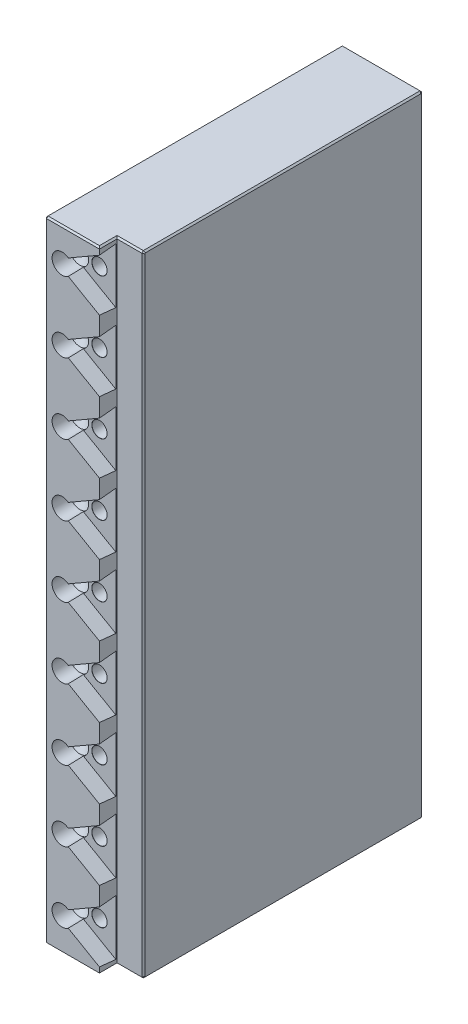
ISO-10303-21;
HEADER;
FILE_DESCRIPTION(('STEP AP214'),'2;1');
FILE_NAME('part.step','',(''),(''),'','','');
FILE_SCHEMA(('AUTOMOTIVE_DESIGN { 1 0 10303 214 1 1 1 1 }'));
ENDSEC;
DATA;
#1=APPLICATION_CONTEXT('core data for automotive mechanical design processes');
#2=APPLICATION_PROTOCOL_DEFINITION('international standard','automotive_design',2000,#1);
#3=PRODUCT_CONTEXT('',#1,'mechanical');
#4=PRODUCT('Part','Part','',(#3));
#5=PRODUCT_RELATED_PRODUCT_CATEGORY('part','',(#4));
#6=PRODUCT_DEFINITION_FORMATION('','',#4);
#7=PRODUCT_DEFINITION_CONTEXT('part definition',#1,'design');
#8=PRODUCT_DEFINITION('design','',#6,#7);
#9=PRODUCT_DEFINITION_SHAPE('','',#8);
#10=(LENGTH_UNIT() NAMED_UNIT(*) SI_UNIT(.MILLI.,.METRE.));
#11=(NAMED_UNIT(*) PLANE_ANGLE_UNIT() SI_UNIT($,.RADIAN.));
#12=(NAMED_UNIT(*) SI_UNIT($,.STERADIAN.) SOLID_ANGLE_UNIT());
#13=UNCERTAINTY_MEASURE_WITH_UNIT(LENGTH_MEASURE(1.E-05),#10,'distance_accuracy_value','');
#14=(GEOMETRIC_REPRESENTATION_CONTEXT(3) GLOBAL_UNCERTAINTY_ASSIGNED_CONTEXT((#13)) GLOBAL_UNIT_ASSIGNED_CONTEXT((#10,
#11,#12)) REPRESENTATION_CONTEXT('',''));
#15=CARTESIAN_POINT('',(0.,0.,0.));
#16=DIRECTION('',(0.,0.,1.));
#17=DIRECTION('',(1.,0.,0.));
#18=AXIS2_PLACEMENT_3D('',#15,#16,#17);
#19=CARTESIAN_POINT('',(7.55,-42.,55.7499999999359));
#20=DIRECTION('',(0.,0.,1.));
#21=DIRECTION('',(1.,0.,0.));
#22=AXIS2_PLACEMENT_3D('',#19,#20,#21);
#23=CONICAL_SURFACE('',#22,1.52499999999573,0.785398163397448);
#24=CARTESIAN_POINT('',(7.55,-42.,55.7249999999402));
#25=DIRECTION('',(0.,0.,1.));
#26=DIRECTION('',(1.,0.,0.));
#27=AXIS2_PLACEMENT_3D('',#24,#25,#26);
#28=CIRCLE('',#27,1.5);
#29=CARTESIAN_POINT('',(9.05,-42.,55.7249999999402));
#30=VERTEX_POINT('',#29);
#31=EDGE_CURVE('E1075',#30,#30,#28,.F.);
#32=ORIENTED_EDGE('',*,*,#31,.T.);
#33=EDGE_LOOP('',(#32));
#34=FACE_BOUND('',#33,.T.);
#35=CARTESIAN_POINT('',(7.55,-42.,55.7499999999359));
#36=DIRECTION('',(0.,0.,1.));
#37=DIRECTION('',(1.,0.,0.));
#38=AXIS2_PLACEMENT_3D('',#35,#36,#37);
#39=CIRCLE('',#38,1.52499999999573);
#40=CARTESIAN_POINT('',(9.07499999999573,-42.,55.7499999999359));
#41=VERTEX_POINT('',#40);
#42=EDGE_CURVE('E945',#41,#41,#39,.T.);
#43=ORIENTED_EDGE('',*,*,#42,.T.);
#44=EDGE_LOOP('',(#43));
#45=FACE_BOUND('',#44,.T.);
#46=ADVANCED_FACE('F14',(#34,#45),#23,.F.);
#47=CARTESIAN_POINT('',(7.55,-28.,55.7499999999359));
#48=DIRECTION('',(0.,0.,1.));
#49=DIRECTION('',(1.,0.,0.));
#50=AXIS2_PLACEMENT_3D('',#47,#48,#49);
#51=CONICAL_SURFACE('',#50,1.52499999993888,0.785398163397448);
#52=CARTESIAN_POINT('',(7.55,-28.,55.724999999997));
#53=DIRECTION('',(0.,0.,1.));
#54=DIRECTION('',(1.,0.,0.));
#55=AXIS2_PLACEMENT_3D('',#52,#53,#54);
#56=CIRCLE('',#55,1.5);
#57=CARTESIAN_POINT('',(9.05,-28.,55.724999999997));
#58=VERTEX_POINT('',#57);
#59=EDGE_CURVE('E1078',#58,#58,#56,.F.);
#60=ORIENTED_EDGE('',*,*,#59,.T.);
#61=EDGE_LOOP('',(#60));
#62=FACE_BOUND('',#61,.T.);
#63=CARTESIAN_POINT('',(7.55,-28.,55.7499999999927));
#64=DIRECTION('',(0.,0.,1.));
#65=DIRECTION('',(1.,0.,0.));
#66=AXIS2_PLACEMENT_3D('',#63,#64,#65);
#67=CIRCLE('',#66,1.52499999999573);
#68=CARTESIAN_POINT('',(9.07499999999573,-28.,55.7499999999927));
#69=VERTEX_POINT('',#68);
#70=EDGE_CURVE('E1068',#69,#69,#67,.T.);
#71=ORIENTED_EDGE('',*,*,#70,.T.);
#72=EDGE_LOOP('',(#71));
#73=FACE_BOUND('',#72,.T.);
#74=ADVANCED_FACE('F2346',(#62,#73),#51,.F.);
#75=CARTESIAN_POINT('',(7.55,-14.,55.7499999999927));
#76=DIRECTION('',(0.,0.,1.));
#77=DIRECTION('',(1.,0.,0.));
#78=AXIS2_PLACEMENT_3D('',#75,#76,#77);
#79=CONICAL_SURFACE('',#78,1.52499999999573,0.785398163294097);
#80=CARTESIAN_POINT('',(7.55,-14.,55.7249999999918));
#81=DIRECTION('',(0.,0.,1.));
#82=DIRECTION('',(1.,0.,0.));
#83=AXIS2_PLACEMENT_3D('',#80,#81,#82);
#84=CIRCLE('',#83,1.5);
#85=CARTESIAN_POINT('',(9.05,-14.,55.7249999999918));
#86=VERTEX_POINT('',#85);
#87=EDGE_CURVE('E1081',#86,#86,#84,.F.);
#88=ORIENTED_EDGE('',*,*,#87,.T.);
#89=EDGE_LOOP('',(#88));
#90=FACE_BOUND('',#89,.T.);
#91=CARTESIAN_POINT('',(7.55,-14.,55.7499999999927));
#92=DIRECTION('',(0.,0.,1.));
#93=DIRECTION('',(1.,0.,0.));
#94=AXIS2_PLACEMENT_3D('',#91,#92,#93);
#95=CIRCLE('',#94,1.52499999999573);
#96=CARTESIAN_POINT('',(9.07499999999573,-14.,55.7499999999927));
#97=VERTEX_POINT('',#96);
#98=EDGE_CURVE('E1065',#97,#97,#95,.T.);
#99=ORIENTED_EDGE('',*,*,#98,.T.);
#100=EDGE_LOOP('',(#99));
#101=FACE_BOUND('',#100,.T.);
#102=ADVANCED_FACE('F2336',(#90,#101),#79,.F.);
#103=CARTESIAN_POINT('',(7.55,0.,55.749999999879));
#104=DIRECTION('',(0.,0.,1.));
#105=DIRECTION('',(0.,-1.,0.));
#106=AXIS2_PLACEMENT_3D('',#103,#104,#105);
#107=CONICAL_SURFACE('',#106,1.52499999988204,0.785398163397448);
#108=CARTESIAN_POINT('',(7.55,0.,55.724999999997));
#109=DIRECTION('',(0.,0.,1.));
#110=DIRECTION('',(0.,-1.,0.));
#111=AXIS2_PLACEMENT_3D('',#108,#109,#110);
#112=CIRCLE('',#111,1.5);
#113=CARTESIAN_POINT('',(7.55,-1.5,55.724999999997));
#114=VERTEX_POINT('',#113);
#115=EDGE_CURVE('E1084',#114,#114,#112,.F.);
#116=ORIENTED_EDGE('',*,*,#115,.T.);
#117=EDGE_LOOP('',(#116));
#118=FACE_BOUND('',#117,.T.);
#119=CARTESIAN_POINT('',(7.55,0.,55.7499999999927));
#120=DIRECTION('',(0.,0.,1.));
#121=DIRECTION('',(0.,-1.,0.));
#122=AXIS2_PLACEMENT_3D('',#119,#120,#121);
#123=CIRCLE('',#122,1.52499999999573);
#124=CARTESIAN_POINT('',(7.55,-1.52499999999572,55.7499999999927));
#125=VERTEX_POINT('',#124);
#126=EDGE_CURVE('E1062',#125,#125,#123,.T.);
#127=ORIENTED_EDGE('',*,*,#126,.T.);
#128=EDGE_LOOP('',(#127));
#129=FACE_BOUND('',#128,.T.);
#130=ADVANCED_FACE('F2326',(#118,#129),#107,.F.);
#131=CARTESIAN_POINT('',(7.55,14.,55.7499999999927));
#132=DIRECTION('',(0.,0.,1.));
#133=DIRECTION('',(1.,0.,0.));
#134=AXIS2_PLACEMENT_3D('',#131,#132,#133);
#135=CONICAL_SURFACE('',#134,1.52499999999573,0.785398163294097);
#136=CARTESIAN_POINT('',(7.55,14.,55.7249999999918));
#137=DIRECTION('',(0.,0.,1.));
#138=DIRECTION('',(1.,0.,0.));
#139=AXIS2_PLACEMENT_3D('',#136,#137,#138);
#140=CIRCLE('',#139,1.5);
#141=CARTESIAN_POINT('',(9.05,14.,55.7249999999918));
#142=VERTEX_POINT('',#141);
#143=EDGE_CURVE('E1087',#142,#142,#140,.F.);
#144=ORIENTED_EDGE('',*,*,#143,.T.);
#145=EDGE_LOOP('',(#144));
#146=FACE_BOUND('',#145,.T.);
#147=CARTESIAN_POINT('',(7.55,14.,55.7499999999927));
#148=DIRECTION('',(0.,0.,1.));
#149=DIRECTION('',(1.,0.,0.));
#150=AXIS2_PLACEMENT_3D('',#147,#148,#149);
#151=CIRCLE('',#150,1.52499999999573);
#152=CARTESIAN_POINT('',(9.07499999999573,14.,55.7499999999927));
#153=VERTEX_POINT('',#152);
#154=EDGE_CURVE('E1059',#153,#153,#151,.T.);
#155=ORIENTED_EDGE('',*,*,#154,.T.);
#156=EDGE_LOOP('',(#155));
#157=FACE_BOUND('',#156,.T.);
#158=ADVANCED_FACE('F1406',(#146,#157),#135,.F.);
#159=CARTESIAN_POINT('',(7.55,28.,55.7499999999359));
#160=DIRECTION('',(0.,0.,1.));
#161=DIRECTION('',(1.,0.,0.));
#162=AXIS2_PLACEMENT_3D('',#159,#160,#161);
#163=CONICAL_SURFACE('',#162,1.52499999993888,0.785398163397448);
#164=CARTESIAN_POINT('',(7.55,28.,55.724999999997));
#165=DIRECTION('',(0.,0.,1.));
#166=DIRECTION('',(1.,0.,0.));
#167=AXIS2_PLACEMENT_3D('',#164,#165,#166);
#168=CIRCLE('',#167,1.5);
#169=CARTESIAN_POINT('',(9.05,28.,55.724999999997));
#170=VERTEX_POINT('',#169);
#171=EDGE_CURVE('E1090',#170,#170,#168,.F.);
#172=ORIENTED_EDGE('',*,*,#171,.T.);
#173=EDGE_LOOP('',(#172));
#174=FACE_BOUND('',#173,.T.);
#175=CARTESIAN_POINT('',(7.55,28.,55.7499999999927));
#176=DIRECTION('',(0.,0.,1.));
#177=DIRECTION('',(1.,0.,0.));
#178=AXIS2_PLACEMENT_3D('',#175,#176,#177);
#179=CIRCLE('',#178,1.52499999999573);
#180=CARTESIAN_POINT('',(9.07499999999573,28.,55.7499999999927));
#181=VERTEX_POINT('',#180);
#182=EDGE_CURVE('E1056',#181,#181,#179,.T.);
#183=ORIENTED_EDGE('',*,*,#182,.T.);
#184=EDGE_LOOP('',(#183));
#185=FACE_BOUND('',#184,.T.);
#186=ADVANCED_FACE('F1397',(#174,#185),#163,.F.);
#187=CARTESIAN_POINT('',(7.55,42.,55.7499999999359));
#188=DIRECTION('',(0.,0.,1.));
#189=DIRECTION('',(1.,0.,0.));
#190=AXIS2_PLACEMENT_3D('',#187,#188,#189);
#191=CONICAL_SURFACE('',#190,1.52499999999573,0.785398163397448);
#192=CARTESIAN_POINT('',(7.55,42.,55.7249999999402));
#193=DIRECTION('',(0.,0.,1.));
#194=DIRECTION('',(1.,0.,0.));
#195=AXIS2_PLACEMENT_3D('',#192,#193,#194);
#196=CIRCLE('',#195,1.5);
#197=CARTESIAN_POINT('',(9.05,42.,55.7249999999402));
#198=VERTEX_POINT('',#197);
#199=EDGE_CURVE('E1092',#198,#198,#196,.F.);
#200=ORIENTED_EDGE('',*,*,#199,.T.);
#201=EDGE_LOOP('',(#200));
#202=FACE_BOUND('',#201,.T.);
#203=CARTESIAN_POINT('',(7.55,42.,55.7499999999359));
#204=DIRECTION('',(0.,0.,1.));
#205=DIRECTION('',(1.,0.,0.));
#206=AXIS2_PLACEMENT_3D('',#203,#204,#205);
#207=CIRCLE('',#206,1.52499999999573);
#208=CARTESIAN_POINT('',(9.07499999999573,42.,55.7499999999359));
#209=VERTEX_POINT('',#208);
#210=EDGE_CURVE('E1053',#209,#209,#207,.T.);
#211=ORIENTED_EDGE('',*,*,#210,.T.);
#212=EDGE_LOOP('',(#211));
#213=FACE_BOUND('',#212,.T.);
#214=ADVANCED_FACE('F1394',(#202,#213),#191,.F.);
#215=CARTESIAN_POINT('',(7.55,56.,55.7499999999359));
#216=DIRECTION('',(0.,0.,1.));
#217=DIRECTION('',(1.,0.,0.));
#218=AXIS2_PLACEMENT_3D('',#215,#216,#217);
#219=CONICAL_SURFACE('',#218,1.52499999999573,0.785398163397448);
#220=CARTESIAN_POINT('',(7.55,56.,55.7249999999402));
#221=DIRECTION('',(0.,0.,1.));
#222=DIRECTION('',(1.,0.,0.));
#223=AXIS2_PLACEMENT_3D('',#220,#221,#222);
#224=CIRCLE('',#223,1.5);
#225=CARTESIAN_POINT('',(9.05,56.,55.7249999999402));
#226=VERTEX_POINT('',#225);
#227=EDGE_CURVE('E17',#226,#226,#224,.F.);
#228=ORIENTED_EDGE('',*,*,#227,.T.);
#229=EDGE_LOOP('',(#228));
#230=FACE_BOUND('',#229,.T.);
#231=CARTESIAN_POINT('',(7.55,56.,55.7499999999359));
#232=DIRECTION('',(0.,0.,1.));
#233=DIRECTION('',(1.,0.,0.));
#234=AXIS2_PLACEMENT_3D('',#231,#232,#233);
#235=CIRCLE('',#234,1.52499999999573);
#236=CARTESIAN_POINT('',(9.07499999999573,56.,55.7499999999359));
#237=VERTEX_POINT('',#236);
#238=EDGE_CURVE('E1050',#237,#237,#235,.T.);
#239=ORIENTED_EDGE('',*,*,#238,.T.);
#240=EDGE_LOOP('',(#239));
#241=FACE_BOUND('',#240,.T.);
#242=ADVANCED_FACE('F1396',(#230,#241),#219,.F.);
#243=CARTESIAN_POINT('',(7.55,-56.,55.7499999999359));
#244=DIRECTION('',(0.,0.,1.));
#245=DIRECTION('',(1.,0.,0.));
#246=AXIS2_PLACEMENT_3D('',#243,#244,#245);
#247=CONICAL_SURFACE('',#246,1.52499999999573,0.785398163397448);
#248=CARTESIAN_POINT('',(7.55,-56.,55.7249999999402));
#249=DIRECTION('',(0.,0.,1.));
#250=DIRECTION('',(1.,0.,0.));
#251=AXIS2_PLACEMENT_3D('',#248,#249,#250);
#252=CIRCLE('',#251,1.5);
#253=CARTESIAN_POINT('',(9.05,-56.,55.7249999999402));
#254=VERTEX_POINT('',#253);
#255=EDGE_CURVE('E946',#254,#254,#252,.F.);
#256=ORIENTED_EDGE('',*,*,#255,.T.);
#257=EDGE_LOOP('',(#256));
#258=FACE_BOUND('',#257,.T.);
#259=CARTESIAN_POINT('',(7.55,-56.,55.7499999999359));
#260=DIRECTION('',(0.,0.,1.));
#261=DIRECTION('',(1.,0.,0.));
#262=AXIS2_PLACEMENT_3D('',#259,#260,#261);
#263=CIRCLE('',#262,1.52499999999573);
#264=CARTESIAN_POINT('',(9.07499999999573,-56.,55.7499999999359));
#265=VERTEX_POINT('',#264);
#266=EDGE_CURVE('E848',#265,#265,#263,.T.);
#267=ORIENTED_EDGE('',*,*,#266,.T.);
#268=EDGE_LOOP('',(#267));
#269=FACE_BOUND('',#268,.T.);
#270=ADVANCED_FACE('F1404',(#258,#269),#247,.F.);
#271=CARTESIAN_POINT('',(16.,-62.5,55.2));
#272=DIRECTION('',(-0.707106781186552,0.,-0.707106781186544));
#273=DIRECTION('',(-0.707106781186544,0.,0.707106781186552));
#274=AXIS2_PLACEMENT_3D('',#271,#272,#273);
#275=PLANE('',#274);
#276=DIRECTION('',(0.,1.,0.));
#277=VECTOR('',#276,1.);
#278=CARTESIAN_POINT('',(15.7,0.,55.5));
#279=LINE('',#278,#277);
#280=CARTESIAN_POINT('',(15.7,-62.2,55.5));
#281=VERTEX_POINT('',#280);
#282=CARTESIAN_POINT('',(15.7,62.2,55.5));
#283=VERTEX_POINT('',#282);
#284=EDGE_CURVE('E770',#281,#283,#279,.T.);
#285=ORIENTED_EDGE('',*,*,#284,.F.);
#286=DIRECTION('',(0.678598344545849,0.281084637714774,-0.678598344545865));
#287=VECTOR('',#286,1.);
#288=CARTESIAN_POINT('',(15.7,-62.2,55.5));
#289=LINE('',#288,#287);
#290=CARTESIAN_POINT('',(16.,-62.0757359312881,55.2));
#291=VERTEX_POINT('',#290);
#292=EDGE_CURVE('E835',#281,#291,#289,.T.);
#293=ORIENTED_EDGE('',*,*,#292,.T.);
#294=DIRECTION('',(0.,1.,0.));
#295=VECTOR('',#294,1.);
#296=CARTESIAN_POINT('',(16.,-62.5,55.2));
#297=LINE('',#296,#295);
#298=CARTESIAN_POINT('',(16.,62.0757359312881,55.2));
#299=VERTEX_POINT('',#298);
#300=EDGE_CURVE('E834',#299,#291,#297,.F.);
#301=ORIENTED_EDGE('',*,*,#300,.F.);
#302=DIRECTION('',(0.678598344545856,-0.281084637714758,-0.678598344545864));
#303=VECTOR('',#302,1.);
#304=CARTESIAN_POINT('',(15.7,62.2,55.5));
#305=LINE('',#304,#303);
#306=EDGE_CURVE('E943',#283,#299,#305,.T.);
#307=ORIENTED_EDGE('',*,*,#306,.F.);
#308=EDGE_LOOP('',(#285,#293,#301,#307));
#309=FACE_BOUND('',#308,.T.);
#310=ADVANCED_FACE('F1631',(#309),#275,.F.);
#311=CARTESIAN_POINT('',(3.4,56.,55.499999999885));
#312=DIRECTION('',(0.,0.,1.));
#313=DIRECTION('',(1.,0.,0.));
#314=AXIS2_PLACEMENT_3D('',#311,#312,#313);
#315=CONICAL_SURFACE('',#314,1.9999999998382,1.02974425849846);
#316=CARTESIAN_POINT('',(3.39999999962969,56.,54.2982787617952));
#317=VERTEX_POINT('',#316);
#318=VERTEX_LOOP('',#317);
#319=FACE_BOUND('',#318,.T.);
#320=CARTESIAN_POINT('',(3.4,56.,55.5));
#321=DIRECTION('',(0.,0.,1.));
#322=DIRECTION('',(1.,0.,0.));
#323=AXIS2_PLACEMENT_3D('',#320,#321,#322);
#324=CIRCLE('',#323,2.);
#325=CARTESIAN_POINT('',(5.4,56.,55.5));
#326=VERTEX_POINT('',#325);
#327=EDGE_CURVE('E937',#326,#326,#324,.T.);
#328=ORIENTED_EDGE('',*,*,#327,.T.);
#329=EDGE_LOOP('',(#328));
#330=FACE_BOUND('',#329,.T.);
#331=ADVANCED_FACE('F1627',(#319,#330),#315,.F.);
#332=CARTESIAN_POINT('',(3.4,42.,55.499999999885));
#333=DIRECTION('',(0.,0.,1.));
#334=DIRECTION('',(1.,0.,0.));
#335=AXIS2_PLACEMENT_3D('',#332,#333,#334);
#336=CONICAL_SURFACE('',#335,1.9999999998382,1.02974425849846);
#337=CARTESIAN_POINT('',(3.39999999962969,42.,54.2982787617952));
#338=VERTEX_POINT('',#337);
#339=VERTEX_LOOP('',#338);
#340=FACE_BOUND('',#339,.T.);
#341=CARTESIAN_POINT('',(3.4,42.,55.5));
#342=DIRECTION('',(0.,0.,1.));
#343=DIRECTION('',(1.,0.,0.));
#344=AXIS2_PLACEMENT_3D('',#341,#342,#343);
#345=CIRCLE('',#344,2.);
#346=CARTESIAN_POINT('',(5.4,42.,55.5));
#347=VERTEX_POINT('',#346);
#348=EDGE_CURVE('E933',#347,#347,#345,.T.);
#349=ORIENTED_EDGE('',*,*,#348,.T.);
#350=EDGE_LOOP('',(#349));
#351=FACE_BOUND('',#350,.T.);
#352=ADVANCED_FACE('F1623',(#340,#351),#336,.F.);
#353=CARTESIAN_POINT('',(3.4,28.,55.499999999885));
#354=DIRECTION('',(0.,0.,1.));
#355=DIRECTION('',(1.,0.,0.));
#356=AXIS2_PLACEMENT_3D('',#353,#354,#355);
#357=CONICAL_SURFACE('',#356,1.9999999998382,1.02974425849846);
#358=CARTESIAN_POINT('',(3.39999999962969,28.,54.2982787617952));
#359=VERTEX_POINT('',#358);
#360=VERTEX_LOOP('',#359);
#361=FACE_BOUND('',#360,.T.);
#362=CARTESIAN_POINT('',(3.4,28.,55.5));
#363=DIRECTION('',(0.,0.,1.));
#364=DIRECTION('',(1.,0.,0.));
#365=AXIS2_PLACEMENT_3D('',#362,#363,#364);
#366=CIRCLE('',#365,2.);
#367=CARTESIAN_POINT('',(5.4,28.,55.5));
#368=VERTEX_POINT('',#367);
#369=EDGE_CURVE('E929',#368,#368,#366,.T.);
#370=ORIENTED_EDGE('',*,*,#369,.T.);
#371=EDGE_LOOP('',(#370));
#372=FACE_BOUND('',#371,.T.);
#373=ADVANCED_FACE('F1619',(#361,#372),#357,.F.);
#374=CARTESIAN_POINT('',(3.4,14.,55.499999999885));
#375=DIRECTION('',(0.,0.,1.));
#376=DIRECTION('',(1.,0.,0.));
#377=AXIS2_PLACEMENT_3D('',#374,#375,#376);
#378=CONICAL_SURFACE('',#377,1.99999999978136,1.02974425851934);
#379=CARTESIAN_POINT('',(3.4,14.,54.2982787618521));
#380=VERTEX_POINT('',#379);
#381=VERTEX_LOOP('',#380);
#382=FACE_BOUND('',#381,.T.);
#383=CARTESIAN_POINT('',(3.4,14.,55.5));
#384=DIRECTION('',(0.,0.,1.));
#385=DIRECTION('',(1.,0.,0.));
#386=AXIS2_PLACEMENT_3D('',#383,#384,#385);
#387=CIRCLE('',#386,2.);
#388=CARTESIAN_POINT('',(5.4,14.,55.5));
#389=VERTEX_POINT('',#388);
#390=EDGE_CURVE('E925',#389,#389,#387,.T.);
#391=ORIENTED_EDGE('',*,*,#390,.T.);
#392=EDGE_LOOP('',(#391));
#393=FACE_BOUND('',#392,.T.);
#394=ADVANCED_FACE('F1615',(#382,#393),#378,.F.);
#395=CARTESIAN_POINT('',(3.4,0.,55.499999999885));
#396=DIRECTION('',(0.,0.,1.));
#397=DIRECTION('',(1.,0.,0.));
#398=AXIS2_PLACEMENT_3D('',#395,#396,#397);
#399=CONICAL_SURFACE('',#398,1.9999999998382,1.02974425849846);
#400=CARTESIAN_POINT('',(3.4,0.,54.2982787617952));
#401=VERTEX_POINT('',#400);
#402=VERTEX_LOOP('',#401);
#403=FACE_BOUND('',#402,.T.);
#404=CARTESIAN_POINT('',(3.4,0.,55.5));
#405=DIRECTION('',(0.,0.,1.));
#406=DIRECTION('',(1.,0.,0.));
#407=AXIS2_PLACEMENT_3D('',#404,#405,#406);
#408=CIRCLE('',#407,2.);
#409=CARTESIAN_POINT('',(5.4,0.,55.5));
#410=VERTEX_POINT('',#409);
#411=EDGE_CURVE('E921',#410,#410,#408,.T.);
#412=ORIENTED_EDGE('',*,*,#411,.T.);
#413=EDGE_LOOP('',(#412));
#414=FACE_BOUND('',#413,.T.);
#415=ADVANCED_FACE('F1611',(#403,#414),#399,.F.);
#416=CARTESIAN_POINT('',(3.4,-14.,55.499999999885));
#417=DIRECTION('',(0.,0.,1.));
#418=DIRECTION('',(1.,0.,0.));
#419=AXIS2_PLACEMENT_3D('',#416,#417,#418);
#420=CONICAL_SURFACE('',#419,1.9999999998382,1.02974425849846);
#421=CARTESIAN_POINT('',(3.40000000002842,-14.,54.2982787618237));
#422=VERTEX_POINT('',#421);
#423=VERTEX_LOOP('',#422);
#424=FACE_BOUND('',#423,.T.);
#425=CARTESIAN_POINT('',(3.4,-14.,55.5));
#426=DIRECTION('',(0.,0.,1.));
#427=DIRECTION('',(1.,0.,0.));
#428=AXIS2_PLACEMENT_3D('',#425,#426,#427);
#429=CIRCLE('',#428,2.);
#430=CARTESIAN_POINT('',(5.4,-14.,55.5));
#431=VERTEX_POINT('',#430);
#432=EDGE_CURVE('E917',#431,#431,#429,.T.);
#433=ORIENTED_EDGE('',*,*,#432,.T.);
#434=EDGE_LOOP('',(#433));
#435=FACE_BOUND('',#434,.T.);
#436=ADVANCED_FACE('F1607',(#424,#435),#420,.F.);
#437=CARTESIAN_POINT('',(3.4,-28.,55.499999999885));
#438=DIRECTION('',(0.,0.,1.));
#439=DIRECTION('',(1.,0.,0.));
#440=AXIS2_PLACEMENT_3D('',#437,#438,#439);
#441=CONICAL_SURFACE('',#440,1.9999999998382,1.02974425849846);
#442=CARTESIAN_POINT('',(3.39999999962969,-28.,54.2982787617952));
#443=VERTEX_POINT('',#442);
#444=VERTEX_LOOP('',#443);
#445=FACE_BOUND('',#444,.T.);
#446=CARTESIAN_POINT('',(3.4,-28.,55.5));
#447=DIRECTION('',(0.,0.,1.));
#448=DIRECTION('',(1.,0.,0.));
#449=AXIS2_PLACEMENT_3D('',#446,#447,#448);
#450=CIRCLE('',#449,2.);
#451=CARTESIAN_POINT('',(5.4,-28.,55.5));
#452=VERTEX_POINT('',#451);
#453=EDGE_CURVE('E913',#452,#452,#450,.T.);
#454=ORIENTED_EDGE('',*,*,#453,.T.);
#455=EDGE_LOOP('',(#454));
#456=FACE_BOUND('',#455,.T.);
#457=ADVANCED_FACE('F1603',(#445,#456),#441,.F.);
#458=CARTESIAN_POINT('',(3.4,-42.,55.499999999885));
#459=DIRECTION('',(0.,0.,1.));
#460=DIRECTION('',(1.,0.,0.));
#461=AXIS2_PLACEMENT_3D('',#458,#459,#460);
#462=CONICAL_SURFACE('',#461,1.9999999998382,1.02974425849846);
#463=CARTESIAN_POINT('',(3.39999999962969,-42.,54.2982787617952));
#464=VERTEX_POINT('',#463);
#465=VERTEX_LOOP('',#464);
#466=FACE_BOUND('',#465,.T.);
#467=CARTESIAN_POINT('',(3.4,-42.,55.5));
#468=DIRECTION('',(0.,0.,1.));
#469=DIRECTION('',(1.,0.,0.));
#470=AXIS2_PLACEMENT_3D('',#467,#468,#469);
#471=CIRCLE('',#470,2.);
#472=CARTESIAN_POINT('',(5.4,-42.,55.5));
#473=VERTEX_POINT('',#472);
#474=EDGE_CURVE('E909',#473,#473,#471,.T.);
#475=ORIENTED_EDGE('',*,*,#474,.T.);
#476=EDGE_LOOP('',(#475));
#477=FACE_BOUND('',#476,.T.);
#478=ADVANCED_FACE('F1599',(#466,#477),#462,.F.);
#479=CARTESIAN_POINT('',(2.48,-42.,55.75));
#480=DIRECTION('',(0.,0.,-1.));
#481=DIRECTION('',(0.,1.,0.));
#482=AXIS2_PLACEMENT_3D('',#479,#480,#481);
#483=PLANE('',#482);
#484=DIRECTION('',(-0.86602540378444,-0.5,0.));
#485=VECTOR('',#484,1.);
#486=CARTESIAN_POINT('',(2.18625566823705,-41.4912198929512,55.75));
#487=LINE('',#486,#485);
#488=CARTESIAN_POINT('',(10.8,-36.5180722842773,55.75));
#489=VERTEX_POINT('',#488);
#490=CARTESIAN_POINT('',(4.35174732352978,-40.24097270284,55.75));
#491=VERTEX_POINT('',#490);
#492=EDGE_CURVE('E538',#489,#491,#487,.T.);
#493=ORIENTED_EDGE('',*,*,#492,.T.);
#494=CARTESIAN_POINT('',(3.4,-42.,55.75));
#495=DIRECTION('',(0.,0.,1.));
#496=DIRECTION('',(1.,0.,0.));
#497=AXIS2_PLACEMENT_3D('',#494,#495,#496);
#498=CIRCLE('',#497,2.);
#499=CARTESIAN_POINT('',(4.35174732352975,-43.7590272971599,55.75));
#500=VERTEX_POINT('',#499);
#501=EDGE_CURVE('E912',#491,#500,#498,.F.);
#502=ORIENTED_EDGE('',*,*,#501,.T.);
#503=DIRECTION('',(0.866025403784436,-0.5,0.));
#504=VECTOR('',#503,1.);
#505=CARTESIAN_POINT('',(12.756255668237,-48.6113724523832,55.75));
#506=LINE('',#505,#504);
#507=CARTESIAN_POINT('',(10.8,-47.4819277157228,55.75));
#508=VERTEX_POINT('',#507);
#509=EDGE_CURVE('E532',#500,#508,#506,.T.);
#510=ORIENTED_EDGE('',*,*,#509,.T.);
#511=DIRECTION('',(0.,-1.,0.));
#512=VECTOR('',#511,1.);
#513=CARTESIAN_POINT('',(10.8,-86.4863613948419,55.75));
#514=LINE('',#513,#512);
#515=EDGE_CURVE('E528',#508,#489,#514,.F.);
#516=ORIENTED_EDGE('',*,*,#515,.T.);
#517=EDGE_LOOP('',(#493,#502,#510,#516));
#518=FACE_BOUND('',#517,.T.);
#519=ORIENTED_EDGE('',*,*,#42,.F.);
#520=EDGE_LOOP('',(#519));
#521=FACE_BOUND('',#520,.T.);
#522=ADVANCED_FACE('F1595',(#518,#521),#483,.F.);
#523=CARTESIAN_POINT('',(2.48,-28.,55.75));
#524=DIRECTION('',(0.,0.,-1.));
#525=DIRECTION('',(0.,1.,0.));
#526=AXIS2_PLACEMENT_3D('',#523,#524,#525);
#527=PLANE('',#526);
#528=DIRECTION('',(-0.86602540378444,-0.5,0.));
#529=VECTOR('',#528,1.);
#530=CARTESIAN_POINT('',(2.18625566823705,-27.4912198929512,55.75));
#531=LINE('',#530,#529);
#532=CARTESIAN_POINT('',(10.8,-22.5180722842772,55.75));
#533=VERTEX_POINT('',#532);
#534=CARTESIAN_POINT('',(4.35174732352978,-26.2409727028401,55.75));
#535=VERTEX_POINT('',#534);
#536=EDGE_CURVE('E566',#533,#535,#531,.T.);
#537=ORIENTED_EDGE('',*,*,#536,.T.);
#538=CARTESIAN_POINT('',(3.4,-28.,55.75));
#539=DIRECTION('',(0.,0.,1.));
#540=DIRECTION('',(1.,0.,0.));
#541=AXIS2_PLACEMENT_3D('',#538,#539,#540);
#542=CIRCLE('',#541,2.);
#543=CARTESIAN_POINT('',(4.35174732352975,-29.7590272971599,55.75));
#544=VERTEX_POINT('',#543);
#545=EDGE_CURVE('E916',#535,#544,#542,.F.);
#546=ORIENTED_EDGE('',*,*,#545,.T.);
#547=DIRECTION('',(0.866025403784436,-0.5,0.));
#548=VECTOR('',#547,1.);
#549=CARTESIAN_POINT('',(12.756255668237,-34.6113724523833,55.75));
#550=LINE('',#549,#548);
#551=CARTESIAN_POINT('',(10.8,-33.4819277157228,55.75));
#552=VERTEX_POINT('',#551);
#553=EDGE_CURVE('E542',#544,#552,#550,.T.);
#554=ORIENTED_EDGE('',*,*,#553,.T.);
#555=DIRECTION('',(0.,-1.,0.));
#556=VECTOR('',#555,1.);
#557=CARTESIAN_POINT('',(10.8,-86.4863613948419,55.75));
#558=LINE('',#557,#556);
#559=EDGE_CURVE('E559',#552,#533,#558,.F.);
#560=ORIENTED_EDGE('',*,*,#559,.T.);
#561=EDGE_LOOP('',(#537,#546,#554,#560));
#562=FACE_BOUND('',#561,.T.);
#563=ORIENTED_EDGE('',*,*,#70,.F.);
#564=EDGE_LOOP('',(#563));
#565=FACE_BOUND('',#564,.T.);
#566=ADVANCED_FACE('F1591',(#562,#565),#527,.F.);
#567=CARTESIAN_POINT('',(2.48,-14.,55.75));
#568=DIRECTION('',(0.,0.,-1.));
#569=DIRECTION('',(0.,1.,0.));
#570=AXIS2_PLACEMENT_3D('',#567,#568,#569);
#571=PLANE('',#570);
#572=DIRECTION('',(-0.86602540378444,-0.5,0.));
#573=VECTOR('',#572,1.);
#574=CARTESIAN_POINT('',(2.18625566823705,-13.4912198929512,55.75));
#575=LINE('',#574,#573);
#576=CARTESIAN_POINT('',(10.8,-8.51807228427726,55.75));
#577=VERTEX_POINT('',#576);
#578=CARTESIAN_POINT('',(4.35174732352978,-12.24097270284,55.75));
#579=VERTEX_POINT('',#578);
#580=EDGE_CURVE('E594',#577,#579,#575,.T.);
#581=ORIENTED_EDGE('',*,*,#580,.T.);
#582=CARTESIAN_POINT('',(3.4,-14.,55.75));
#583=DIRECTION('',(0.,0.,1.));
#584=DIRECTION('',(1.,0.,0.));
#585=AXIS2_PLACEMENT_3D('',#582,#583,#584);
#586=CIRCLE('',#585,2.);
#587=CARTESIAN_POINT('',(4.35174732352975,-15.75902729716,55.75));
#588=VERTEX_POINT('',#587);
#589=EDGE_CURVE('E920',#579,#588,#586,.F.);
#590=ORIENTED_EDGE('',*,*,#589,.T.);
#591=DIRECTION('',(0.866025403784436,-0.5,0.));
#592=VECTOR('',#591,1.);
#593=CARTESIAN_POINT('',(12.756255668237,-20.6113724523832,55.75));
#594=LINE('',#593,#592);
#595=CARTESIAN_POINT('',(10.8,-19.4819277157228,55.75));
#596=VERTEX_POINT('',#595);
#597=EDGE_CURVE('E570',#588,#596,#594,.T.);
#598=ORIENTED_EDGE('',*,*,#597,.T.);
#599=DIRECTION('',(0.,-1.,0.));
#600=VECTOR('',#599,1.);
#601=CARTESIAN_POINT('',(10.8,-86.4863613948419,55.75));
#602=LINE('',#601,#600);
#603=EDGE_CURVE('E587',#596,#577,#602,.F.);
#604=ORIENTED_EDGE('',*,*,#603,.T.);
#605=EDGE_LOOP('',(#581,#590,#598,#604));
#606=FACE_BOUND('',#605,.T.);
#607=ORIENTED_EDGE('',*,*,#98,.F.);
#608=EDGE_LOOP('',(#607));
#609=FACE_BOUND('',#608,.T.);
#610=ADVANCED_FACE('F1587',(#606,#609),#571,.F.);
#611=CARTESIAN_POINT('',(2.48,0.,55.75));
#612=DIRECTION('',(0.,0.,-1.));
#613=DIRECTION('',(0.,1.,0.));
#614=AXIS2_PLACEMENT_3D('',#611,#612,#613);
#615=PLANE('',#614);
#616=DIRECTION('',(-0.86602540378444,-0.5,0.));
#617=VECTOR('',#616,1.);
#618=CARTESIAN_POINT('',(2.18625566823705,0.508780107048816,55.75));
#619=LINE('',#618,#617);
#620=CARTESIAN_POINT('',(10.8,5.48192771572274,55.75));
#621=VERTEX_POINT('',#620);
#622=CARTESIAN_POINT('',(4.35174732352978,1.75902729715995,55.75));
#623=VERTEX_POINT('',#622);
#624=EDGE_CURVE('E622',#621,#623,#619,.T.);
#625=ORIENTED_EDGE('',*,*,#624,.T.);
#626=CARTESIAN_POINT('',(3.4,0.,55.75));
#627=DIRECTION('',(0.,0.,1.));
#628=DIRECTION('',(1.,0.,0.));
#629=AXIS2_PLACEMENT_3D('',#626,#627,#628);
#630=CIRCLE('',#629,2.);
#631=CARTESIAN_POINT('',(4.35174732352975,-1.75902729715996,55.75));
#632=VERTEX_POINT('',#631);
#633=EDGE_CURVE('E924',#623,#632,#630,.F.);
#634=ORIENTED_EDGE('',*,*,#633,.T.);
#635=DIRECTION('',(0.866025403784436,-0.5,0.));
#636=VECTOR('',#635,1.);
#637=CARTESIAN_POINT('',(12.756255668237,-6.61137245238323,55.75));
#638=LINE('',#637,#636);
#639=CARTESIAN_POINT('',(10.8,-5.48192771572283,55.75));
#640=VERTEX_POINT('',#639);
#641=EDGE_CURVE('E598',#632,#640,#638,.T.);
#642=ORIENTED_EDGE('',*,*,#641,.T.);
#643=DIRECTION('',(0.,-1.,0.));
#644=VECTOR('',#643,1.);
#645=CARTESIAN_POINT('',(10.8,-86.4863613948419,55.75));
#646=LINE('',#645,#644);
#647=EDGE_CURVE('E615',#640,#621,#646,.F.);
#648=ORIENTED_EDGE('',*,*,#647,.T.);
#649=EDGE_LOOP('',(#625,#634,#642,#648));
#650=FACE_BOUND('',#649,.T.);
#651=ORIENTED_EDGE('',*,*,#126,.F.);
#652=EDGE_LOOP('',(#651));
#653=FACE_BOUND('',#652,.T.);
#654=ADVANCED_FACE('F1583',(#650,#653),#615,.F.);
#655=CARTESIAN_POINT('',(2.48,14.,55.75));
#656=DIRECTION('',(0.,0.,-1.));
#657=DIRECTION('',(0.,1.,0.));
#658=AXIS2_PLACEMENT_3D('',#655,#656,#657);
#659=PLANE('',#658);
#660=DIRECTION('',(-0.86602540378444,-0.5,0.));
#661=VECTOR('',#660,1.);
#662=CARTESIAN_POINT('',(2.18625566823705,14.5087801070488,55.75));
#663=LINE('',#662,#661);
#664=CARTESIAN_POINT('',(10.8,19.4819277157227,55.75));
#665=VERTEX_POINT('',#664);
#666=CARTESIAN_POINT('',(4.35174732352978,15.75902729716,55.75));
#667=VERTEX_POINT('',#666);
#668=EDGE_CURVE('E650',#665,#667,#663,.T.);
#669=ORIENTED_EDGE('',*,*,#668,.T.);
#670=CARTESIAN_POINT('',(3.4,14.,55.75));
#671=DIRECTION('',(0.,0.,1.));
#672=DIRECTION('',(1.,0.,0.));
#673=AXIS2_PLACEMENT_3D('',#670,#671,#672);
#674=CIRCLE('',#673,2.);
#675=CARTESIAN_POINT('',(4.35174732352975,12.24097270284,55.75));
#676=VERTEX_POINT('',#675);
#677=EDGE_CURVE('E928',#667,#676,#674,.F.);
#678=ORIENTED_EDGE('',*,*,#677,.T.);
#679=DIRECTION('',(0.866025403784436,-0.5,0.));
#680=VECTOR('',#679,1.);
#681=CARTESIAN_POINT('',(12.756255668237,7.38862754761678,55.75));
#682=LINE('',#681,#680);
#683=CARTESIAN_POINT('',(10.8,8.51807228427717,55.75));
#684=VERTEX_POINT('',#683);
#685=EDGE_CURVE('E626',#676,#684,#682,.T.);
#686=ORIENTED_EDGE('',*,*,#685,.T.);
#687=DIRECTION('',(0.,-1.,0.));
#688=VECTOR('',#687,1.);
#689=CARTESIAN_POINT('',(10.8,-86.4863613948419,55.75));
#690=LINE('',#689,#688);
#691=EDGE_CURVE('E643',#684,#665,#690,.F.);
#692=ORIENTED_EDGE('',*,*,#691,.T.);
#693=EDGE_LOOP('',(#669,#678,#686,#692));
#694=FACE_BOUND('',#693,.T.);
#695=ORIENTED_EDGE('',*,*,#154,.F.);
#696=EDGE_LOOP('',(#695));
#697=FACE_BOUND('',#696,.T.);
#698=ADVANCED_FACE('F1579',(#694,#697),#659,.F.);
#699=CARTESIAN_POINT('',(2.48,28.,55.75));
#700=DIRECTION('',(0.,0.,-1.));
#701=DIRECTION('',(0.,1.,0.));
#702=AXIS2_PLACEMENT_3D('',#699,#700,#701);
#703=PLANE('',#702);
#704=DIRECTION('',(-0.86602540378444,-0.5,0.));
#705=VECTOR('',#704,1.);
#706=CARTESIAN_POINT('',(2.18625566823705,28.5087801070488,55.75));
#707=LINE('',#706,#705);
#708=CARTESIAN_POINT('',(10.8,33.4819277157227,55.75));
#709=VERTEX_POINT('',#708);
#710=CARTESIAN_POINT('',(4.35174732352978,29.7590272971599,55.75));
#711=VERTEX_POINT('',#710);
#712=EDGE_CURVE('E678',#709,#711,#707,.T.);
#713=ORIENTED_EDGE('',*,*,#712,.T.);
#714=CARTESIAN_POINT('',(3.4,28.,55.75));
#715=DIRECTION('',(0.,0.,1.));
#716=DIRECTION('',(1.,0.,0.));
#717=AXIS2_PLACEMENT_3D('',#714,#715,#716);
#718=CIRCLE('',#717,2.);
#719=CARTESIAN_POINT('',(4.35174732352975,26.2409727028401,55.75));
#720=VERTEX_POINT('',#719);
#721=EDGE_CURVE('E932',#711,#720,#718,.F.);
#722=ORIENTED_EDGE('',*,*,#721,.T.);
#723=DIRECTION('',(0.866025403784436,-0.5,0.));
#724=VECTOR('',#723,1.);
#725=CARTESIAN_POINT('',(12.756255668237,21.3886275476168,55.75));
#726=LINE('',#725,#724);
#727=CARTESIAN_POINT('',(10.8,22.5180722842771,55.75));
#728=VERTEX_POINT('',#727);
#729=EDGE_CURVE('E654',#720,#728,#726,.T.);
#730=ORIENTED_EDGE('',*,*,#729,.T.);
#731=DIRECTION('',(0.,-1.,0.));
#732=VECTOR('',#731,1.);
#733=CARTESIAN_POINT('',(10.8,-86.4863613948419,55.75));
#734=LINE('',#733,#732);
#735=EDGE_CURVE('E671',#728,#709,#734,.F.);
#736=ORIENTED_EDGE('',*,*,#735,.T.);
#737=EDGE_LOOP('',(#713,#722,#730,#736));
#738=FACE_BOUND('',#737,.T.);
#739=ORIENTED_EDGE('',*,*,#182,.F.);
#740=EDGE_LOOP('',(#739));
#741=FACE_BOUND('',#740,.T.);
#742=ADVANCED_FACE('F1390',(#738,#741),#703,.F.);
#743=CARTESIAN_POINT('',(2.48,42.,55.75));
#744=DIRECTION('',(0.,0.,-1.));
#745=DIRECTION('',(0.,1.,0.));
#746=AXIS2_PLACEMENT_3D('',#743,#744,#745);
#747=PLANE('',#746);
#748=DIRECTION('',(-0.86602540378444,-0.5,0.));
#749=VECTOR('',#748,1.);
#750=CARTESIAN_POINT('',(2.18625566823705,42.5087801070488,55.75));
#751=LINE('',#750,#749);
#752=CARTESIAN_POINT('',(10.8,47.4819277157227,55.75));
#753=VERTEX_POINT('',#752);
#754=CARTESIAN_POINT('',(4.35174732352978,43.7590272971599,55.75));
#755=VERTEX_POINT('',#754);
#756=EDGE_CURVE('E706',#753,#755,#751,.T.);
#757=ORIENTED_EDGE('',*,*,#756,.T.);
#758=CARTESIAN_POINT('',(3.4,42.,55.75));
#759=DIRECTION('',(0.,0.,1.));
#760=DIRECTION('',(1.,0.,0.));
#761=AXIS2_PLACEMENT_3D('',#758,#759,#760);
#762=CIRCLE('',#761,2.);
#763=CARTESIAN_POINT('',(4.35174732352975,40.24097270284,55.75));
#764=VERTEX_POINT('',#763);
#765=EDGE_CURVE('E936',#755,#764,#762,.F.);
#766=ORIENTED_EDGE('',*,*,#765,.T.);
#767=DIRECTION('',(0.866025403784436,-0.5,0.));
#768=VECTOR('',#767,1.);
#769=CARTESIAN_POINT('',(12.756255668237,35.3886275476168,55.75));
#770=LINE('',#769,#768);
#771=CARTESIAN_POINT('',(10.8,36.5180722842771,55.75));
#772=VERTEX_POINT('',#771);
#773=EDGE_CURVE('E682',#764,#772,#770,.T.);
#774=ORIENTED_EDGE('',*,*,#773,.T.);
#775=DIRECTION('',(0.,-1.,0.));
#776=VECTOR('',#775,1.);
#777=CARTESIAN_POINT('',(10.8,-86.4863613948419,55.75));
#778=LINE('',#777,#776);
#779=EDGE_CURVE('E699',#772,#753,#778,.F.);
#780=ORIENTED_EDGE('',*,*,#779,.T.);
#781=EDGE_LOOP('',(#757,#766,#774,#780));
#782=FACE_BOUND('',#781,.T.);
#783=ORIENTED_EDGE('',*,*,#210,.F.);
#784=EDGE_LOOP('',(#783));
#785=FACE_BOUND('',#784,.T.);
#786=ADVANCED_FACE('F1387',(#782,#785),#747,.F.);
#787=CARTESIAN_POINT('',(2.48,56.,55.75));
#788=DIRECTION('',(0.,0.,-1.));
#789=DIRECTION('',(0.,1.,0.));
#790=AXIS2_PLACEMENT_3D('',#787,#788,#789);
#791=PLANE('',#790);
#792=DIRECTION('',(-0.86602540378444,-0.5,0.));
#793=VECTOR('',#792,1.);
#794=CARTESIAN_POINT('',(2.18625566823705,56.5087801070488,55.75));
#795=LINE('',#794,#793);
#796=CARTESIAN_POINT('',(10.8,61.4819277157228,55.75));
#797=VERTEX_POINT('',#796);
#798=CARTESIAN_POINT('',(4.35174732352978,57.75902729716,55.75));
#799=VERTEX_POINT('',#798);
#800=EDGE_CURVE('E401',#797,#799,#795,.T.);
#801=ORIENTED_EDGE('',*,*,#800,.T.);
#802=CARTESIAN_POINT('',(3.4,56.,55.75));
#803=DIRECTION('',(0.,0.,1.));
#804=DIRECTION('',(1.,0.,0.));
#805=AXIS2_PLACEMENT_3D('',#802,#803,#804);
#806=CIRCLE('',#805,2.);
#807=CARTESIAN_POINT('',(4.35174732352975,54.24097270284,55.75));
#808=VERTEX_POINT('',#807);
#809=EDGE_CURVE('E398',#799,#808,#806,.F.);
#810=ORIENTED_EDGE('',*,*,#809,.T.);
#811=DIRECTION('',(0.866025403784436,-0.5,0.));
#812=VECTOR('',#811,1.);
#813=CARTESIAN_POINT('',(12.756255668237,49.3886275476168,55.75));
#814=LINE('',#813,#812);
#815=CARTESIAN_POINT('',(10.8,50.5180722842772,55.75));
#816=VERTEX_POINT('',#815);
#817=EDGE_CURVE('E710',#808,#816,#814,.T.);
#818=ORIENTED_EDGE('',*,*,#817,.T.);
#819=DIRECTION('',(0.,-1.,0.));
#820=VECTOR('',#819,1.);
#821=CARTESIAN_POINT('',(10.8,-86.4863613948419,55.75));
#822=LINE('',#821,#820);
#823=EDGE_CURVE('E726',#816,#797,#822,.F.);
#824=ORIENTED_EDGE('',*,*,#823,.T.);
#825=EDGE_LOOP('',(#801,#810,#818,#824));
#826=FACE_BOUND('',#825,.T.);
#827=ORIENTED_EDGE('',*,*,#238,.F.);
#828=EDGE_LOOP('',(#827));
#829=FACE_BOUND('',#828,.T.);
#830=ADVANCED_FACE('F1211',(#826,#829),#791,.F.);
#831=CARTESIAN_POINT('',(3.4,-56.,55.499999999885));
#832=DIRECTION('',(0.,0.,1.));
#833=DIRECTION('',(1.,0.,0.));
#834=AXIS2_PLACEMENT_3D('',#831,#832,#833);
#835=CONICAL_SURFACE('',#834,1.9999999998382,1.02974425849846);
#836=CARTESIAN_POINT('',(3.39999999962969,-56.,54.2982787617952));
#837=VERTEX_POINT('',#836);
#838=VERTEX_LOOP('',#837);
#839=FACE_BOUND('',#838,.T.);
#840=CARTESIAN_POINT('',(3.4,-56.,55.5));
#841=DIRECTION('',(0.,0.,1.));
#842=DIRECTION('',(1.,0.,0.));
#843=AXIS2_PLACEMENT_3D('',#840,#841,#842);
#844=CIRCLE('',#843,2.);
#845=CARTESIAN_POINT('',(5.4,-56.,55.5));
#846=VERTEX_POINT('',#845);
#847=EDGE_CURVE('E503',#846,#846,#844,.T.);
#848=ORIENTED_EDGE('',*,*,#847,.T.);
#849=EDGE_LOOP('',(#848));
#850=FACE_BOUND('',#849,.T.);
#851=ADVANCED_FACE('F1570',(#839,#850),#835,.F.);
#852=CARTESIAN_POINT('',(2.48,-56.,55.75));
#853=DIRECTION('',(0.,0.,-1.));
#854=DIRECTION('',(0.,1.,0.));
#855=AXIS2_PLACEMENT_3D('',#852,#853,#854);
#856=PLANE('',#855);
#857=DIRECTION('',(-0.86602540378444,-0.5,0.));
#858=VECTOR('',#857,1.);
#859=CARTESIAN_POINT('',(2.18625566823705,-55.4912198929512,55.75));
#860=LINE('',#859,#858);
#861=CARTESIAN_POINT('',(10.8,-50.5180722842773,55.75));
#862=VERTEX_POINT('',#861);
#863=CARTESIAN_POINT('',(4.35174732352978,-54.2409727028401,55.75));
#864=VERTEX_POINT('',#863);
#865=EDGE_CURVE('E506',#862,#864,#860,.T.);
#866=ORIENTED_EDGE('',*,*,#865,.T.);
#867=CARTESIAN_POINT('',(3.4,-56.,55.75));
#868=DIRECTION('',(0.,0.,1.));
#869=DIRECTION('',(1.,0.,0.));
#870=AXIS2_PLACEMENT_3D('',#867,#868,#869);
#871=CIRCLE('',#870,2.);
#872=CARTESIAN_POINT('',(4.35174732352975,-57.75902729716,55.75));
#873=VERTEX_POINT('',#872);
#874=EDGE_CURVE('E876',#864,#873,#871,.F.);
#875=ORIENTED_EDGE('',*,*,#874,.T.);
#876=DIRECTION('',(0.866025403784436,-0.5,0.));
#877=VECTOR('',#876,1.);
#878=CARTESIAN_POINT('',(12.756255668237,-62.6113724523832,55.75));
#879=LINE('',#878,#877);
#880=CARTESIAN_POINT('',(10.8,-61.4819277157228,55.75));
#881=VERTEX_POINT('',#880);
#882=EDGE_CURVE('E489',#873,#881,#879,.T.);
#883=ORIENTED_EDGE('',*,*,#882,.T.);
#884=DIRECTION('',(0.,-1.,0.));
#885=VECTOR('',#884,1.);
#886=CARTESIAN_POINT('',(10.8,-86.4863613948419,55.75));
#887=LINE('',#886,#885);
#888=EDGE_CURVE('E529',#881,#862,#887,.F.);
#889=ORIENTED_EDGE('',*,*,#888,.T.);
#890=EDGE_LOOP('',(#866,#875,#883,#889));
#891=FACE_BOUND('',#890,.T.);
#892=ORIENTED_EDGE('',*,*,#266,.F.);
#893=EDGE_LOOP('',(#892));
#894=FACE_BOUND('',#893,.T.);
#895=ADVANCED_FACE('F1566',(#891,#894),#856,.F.);
#896=CARTESIAN_POINT('',(16.,-89.887867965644,27.3878679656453));
#897=DIRECTION('',(-0.707106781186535,0.5,-0.50000000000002));
#898=DIRECTION('',(-0.577350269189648,0.,0.81649658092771));
#899=AXIS2_PLACEMENT_3D('',#896,#897,#898);
#900=PLANE('',#899);
#901=DIRECTION('',(0.,-0.707106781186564,-0.707106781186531));
#902=VECTOR('',#901,1.);
#903=CARTESIAN_POINT('',(15.7,-62.2,55.5));
#904=LINE('',#903,#902);
#905=CARTESIAN_POINT('',(15.7,-62.5,55.2));
#906=VERTEX_POINT('',#905);
#907=EDGE_CURVE('E461',#906,#281,#904,.F.);
#908=ORIENTED_EDGE('',*,*,#907,.F.);
#909=DIRECTION('',(-0.678598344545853,-0.678598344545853,0.281084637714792));
#910=VECTOR('',#909,1.);
#911=CARTESIAN_POINT('',(16.,-62.2,55.0757359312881));
#912=LINE('',#911,#910);
#913=CARTESIAN_POINT('',(16.,-62.2,55.0757359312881));
#914=VERTEX_POINT('',#913);
#915=EDGE_CURVE('E486',#914,#906,#912,.T.);
#916=ORIENTED_EDGE('',*,*,#915,.F.);
#917=DIRECTION('',(0.,-0.707106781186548,-0.707106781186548));
#918=VECTOR('',#917,1.);
#919=CARTESIAN_POINT('',(16.,-62.0757359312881,55.2));
#920=LINE('',#919,#918);
#921=EDGE_CURVE('E777',#291,#914,#920,.T.);
#922=ORIENTED_EDGE('',*,*,#921,.F.);
#923=ORIENTED_EDGE('',*,*,#292,.F.);
#924=EDGE_LOOP('',(#908,#916,#922,#923));
#925=FACE_BOUND('',#924,.T.);
#926=ADVANCED_FACE('F1562',(#925),#900,.F.);
#927=CARTESIAN_POINT('',(16.,-62.137867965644,0.362132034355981));
#928=DIRECTION('',(0.707106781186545,-0.49999999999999,-0.500000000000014));
#929=DIRECTION('',(-0.577350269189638,0.,-0.816496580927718));
#930=AXIS2_PLACEMENT_3D('',#927,#928,#929);
#931=PLANE('',#930);
#932=DIRECTION('',(-0.67859834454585,-0.281084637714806,-0.67859834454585));
#933=VECTOR('',#932,1.);
#934=CARTESIAN_POINT('',(16.,-62.0757359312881,0.300000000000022));
#935=LINE('',#934,#933);
#936=CARTESIAN_POINT('',(16.,-62.0757359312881,0.300000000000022));
#937=VERTEX_POINT('',#936);
#938=CARTESIAN_POINT('',(15.7,-62.2,0.));
#939=VERTEX_POINT('',#938);
#940=EDGE_CURVE('E483',#937,#939,#935,.T.);
#941=ORIENTED_EDGE('',*,*,#940,.F.);
#942=DIRECTION('',(0.,0.707106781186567,-0.707106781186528));
#943=VECTOR('',#942,1.);
#944=CARTESIAN_POINT('',(16.,-62.2,0.424264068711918));
#945=LINE('',#944,#943);
#946=CARTESIAN_POINT('',(16.,-62.2,0.424264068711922));
#947=VERTEX_POINT('',#946);
#948=EDGE_CURVE('E832',#947,#937,#945,.T.);
#949=ORIENTED_EDGE('',*,*,#948,.F.);
#950=DIRECTION('',(0.678598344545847,0.678598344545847,0.281084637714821));
#951=VECTOR('',#950,1.);
#952=CARTESIAN_POINT('',(15.7,-62.5,0.299999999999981));
#953=LINE('',#952,#951);
#954=CARTESIAN_POINT('',(15.7,-62.5,0.299999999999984));
#955=VERTEX_POINT('',#954);
#956=EDGE_CURVE('E488',#955,#947,#953,.T.);
#957=ORIENTED_EDGE('',*,*,#956,.F.);
#958=DIRECTION('',(0.,-0.707106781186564,0.707106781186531));
#959=VECTOR('',#958,1.);
#960=CARTESIAN_POINT('',(15.7,-62.2,0.));
#961=LINE('',#960,#959);
#962=EDGE_CURVE('E478',#955,#939,#961,.F.);
#963=ORIENTED_EDGE('',*,*,#962,.T.);
#964=EDGE_LOOP('',(#941,#949,#957,#963));
#965=FACE_BOUND('',#964,.T.);
#966=ADVANCED_FACE('F1558',(#965),#931,.T.);
#967=CARTESIAN_POINT('',(16.,-62.5,0.));
#968=DIRECTION('',(1.,0.,0.));
#969=DIRECTION('',(0.,1.,0.));
#970=AXIS2_PLACEMENT_3D('',#967,#968,#969);
#971=PLANE('',#970);
#972=ORIENTED_EDGE('',*,*,#300,.T.);
#973=ORIENTED_EDGE('',*,*,#921,.T.);
#974=DIRECTION('',(0.,0.,1.));
#975=VECTOR('',#974,1.);
#976=CARTESIAN_POINT('',(16.,-62.2,0.));
#977=LINE('',#976,#975);
#978=EDGE_CURVE('E474',#947,#914,#977,.T.);
#979=ORIENTED_EDGE('',*,*,#978,.F.);
#980=ORIENTED_EDGE('',*,*,#948,.T.);
#981=DIRECTION('',(0.,1.,0.));
#982=VECTOR('',#981,1.);
#983=CARTESIAN_POINT('',(16.,-62.5,0.300000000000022));
#984=LINE('',#983,#982);
#985=CARTESIAN_POINT('',(16.,62.0757359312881,0.300000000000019));
#986=VERTEX_POINT('',#985);
#987=EDGE_CURVE('E808',#986,#937,#984,.F.);
#988=ORIENTED_EDGE('',*,*,#987,.F.);
#989=DIRECTION('',(0.,-0.707106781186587,-0.707106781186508));
#990=VECTOR('',#989,1.);
#991=CARTESIAN_POINT('',(16.,62.2,0.424264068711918));
#992=LINE('',#991,#990);
#993=CARTESIAN_POINT('',(16.,62.2,0.424264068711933));
#994=VERTEX_POINT('',#993);
#995=EDGE_CURVE('E773',#994,#986,#992,.T.);
#996=ORIENTED_EDGE('',*,*,#995,.F.);
#997=DIRECTION('',(0.,0.,1.));
#998=VECTOR('',#997,1.);
#999=CARTESIAN_POINT('',(16.,62.2,0.));
#1000=LINE('',#999,#998);
#1001=CARTESIAN_POINT('',(16.,62.2,55.0757359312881));
#1002=VERTEX_POINT('',#1001);
#1003=EDGE_CURVE('E437',#1002,#994,#1000,.F.);
#1004=ORIENTED_EDGE('',*,*,#1003,.F.);
#1005=DIRECTION('',(0.,-0.707106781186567,0.707106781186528));
#1006=VECTOR('',#1005,1.);
#1007=CARTESIAN_POINT('',(16.,62.2,55.0757359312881));
#1008=LINE('',#1007,#1006);
#1009=EDGE_CURVE('E734',#1002,#299,#1008,.T.);
#1010=ORIENTED_EDGE('',*,*,#1009,.T.);
#1011=EDGE_LOOP('',(#972,#973,#979,#980,#988,#996,#1004,#1010));
#1012=FACE_BOUND('',#1011,.T.);
#1013=ADVANCED_FACE('F1554',(#1012),#971,.T.);
#1014=CARTESIAN_POINT('',(16.,-0.362132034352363,-62.137867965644));
#1015=DIRECTION('',(0.707106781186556,0.500000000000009,-0.49999999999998));
#1016=DIRECTION('',(-0.577350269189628,0.816496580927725,0.));
#1017=AXIS2_PLACEMENT_3D('',#1014,#1015,#1016);
#1018=PLANE('',#1017);
#1019=DIRECTION('',(0.678598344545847,-0.281084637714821,0.678598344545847));
#1020=VECTOR('',#1019,1.);
#1021=CARTESIAN_POINT('',(15.7,62.2,0.));
#1022=LINE('',#1021,#1020);
#1023=CARTESIAN_POINT('',(15.7,62.2,0.));
#1024=VERTEX_POINT('',#1023);
#1025=EDGE_CURVE('E457',#1024,#986,#1022,.T.);
#1026=ORIENTED_EDGE('',*,*,#1025,.F.);
#1027=DIRECTION('',(0.,-0.707106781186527,-0.707106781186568));
#1028=VECTOR('',#1027,1.);
#1029=CARTESIAN_POINT('',(15.7,62.5,0.300000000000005));
#1030=LINE('',#1029,#1028);
#1031=CARTESIAN_POINT('',(15.7,62.5,0.300000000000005));
#1032=VERTEX_POINT('',#1031);
#1033=EDGE_CURVE('E446',#1024,#1032,#1030,.F.);
#1034=ORIENTED_EDGE('',*,*,#1033,.T.);
#1035=DIRECTION('',(-0.678598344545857,0.678598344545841,-0.281084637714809));
#1036=VECTOR('',#1035,1.);
#1037=CARTESIAN_POINT('',(16.,62.2,0.424264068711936));
#1038=LINE('',#1037,#1036);
#1039=EDGE_CURVE('E435',#994,#1032,#1038,.T.);
#1040=ORIENTED_EDGE('',*,*,#1039,.F.);
#1041=ORIENTED_EDGE('',*,*,#995,.T.);
#1042=EDGE_LOOP('',(#1026,#1034,#1040,#1041));
#1043=FACE_BOUND('',#1042,.T.);
#1044=ADVANCED_FACE('F1550',(#1043),#1018,.T.);
#1045=CARTESIAN_POINT('',(0.,0.,55.5));
#1046=DIRECTION('',(0.,0.,1.));
#1047=DIRECTION('',(1.,0.,0.));
#1048=AXIS2_PLACEMENT_3D('',#1045,#1046,#1047);
#1049=PLANE('',#1048);
#1050=DIRECTION('',(1.,0.,0.));
#1051=VECTOR('',#1050,1.);
#1052=CARTESIAN_POINT('',(0.,62.2,55.5));
#1053=LINE('',#1052,#1051);
#1054=CARTESIAN_POINT('',(10.8,62.2,55.5));
#1055=VERTEX_POINT('',#1054);
#1056=EDGE_CURVE('E432',#1055,#283,#1053,.T.);
#1057=ORIENTED_EDGE('',*,*,#1056,.F.);
#1058=DIRECTION('',(0.,-1.,0.));
#1059=VECTOR('',#1058,1.);
#1060=CARTESIAN_POINT('',(10.8,-86.4863613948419,55.5));
#1061=LINE('',#1060,#1059);
#1062=CARTESIAN_POINT('',(10.8,-62.2,55.5));
#1063=VERTEX_POINT('',#1062);
#1064=EDGE_CURVE('E515',#1055,#1063,#1061,.T.);
#1065=ORIENTED_EDGE('',*,*,#1064,.T.);
#1066=DIRECTION('',(1.,0.,0.));
#1067=VECTOR('',#1066,1.);
#1068=CARTESIAN_POINT('',(0.,-62.2,55.5));
#1069=LINE('',#1068,#1067);
#1070=EDGE_CURVE('E458',#281,#1063,#1069,.F.);
#1071=ORIENTED_EDGE('',*,*,#1070,.F.);
#1072=ORIENTED_EDGE('',*,*,#284,.T.);
#1073=EDGE_LOOP('',(#1057,#1065,#1071,#1072));
#1074=FACE_BOUND('',#1073,.T.);
#1075=ADVANCED_FACE('F1546',(#1074),#1049,.T.);
#1076=CARTESIAN_POINT('',(16.,27.3878679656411,89.8878679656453));
#1077=DIRECTION('',(-0.707106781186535,-0.5,-0.50000000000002));
#1078=DIRECTION('',(-0.577350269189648,0.,0.81649658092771));
#1079=AXIS2_PLACEMENT_3D('',#1076,#1077,#1078);
#1080=PLANE('',#1079);
#1081=DIRECTION('',(0.,-0.707106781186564,0.707106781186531));
#1082=VECTOR('',#1081,1.);
#1083=CARTESIAN_POINT('',(15.7,62.2,55.5));
#1084=LINE('',#1083,#1082);
#1085=CARTESIAN_POINT('',(15.7,62.5,55.2));
#1086=VERTEX_POINT('',#1085);
#1087=EDGE_CURVE('E428',#283,#1086,#1084,.F.);
#1088=ORIENTED_EDGE('',*,*,#1087,.F.);
#1089=ORIENTED_EDGE('',*,*,#306,.T.);
#1090=ORIENTED_EDGE('',*,*,#1009,.F.);
#1091=DIRECTION('',(0.67859834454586,-0.678598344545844,-0.281084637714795));
#1092=VECTOR('',#1091,1.);
#1093=CARTESIAN_POINT('',(15.7,62.5,55.2));
#1094=LINE('',#1093,#1092);
#1095=EDGE_CURVE('E440',#1086,#1002,#1094,.T.);
#1096=ORIENTED_EDGE('',*,*,#1095,.F.);
#1097=EDGE_LOOP('',(#1088,#1089,#1090,#1096));
#1098=FACE_BOUND('',#1097,.T.);
#1099=ADVANCED_FACE('F1543',(#1098),#1080,.F.);
#1100=CARTESIAN_POINT('',(2.23,56.4330127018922,56.75));
#1101=DIRECTION('',(-0.498097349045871,0.862729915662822,0.0871557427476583));
#1102=DIRECTION('',(-0.86602540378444,-0.5,0.));
#1103=AXIS2_PLACEMENT_3D('',#1100,#1101,#1102);
#1104=PLANE('',#1103);
#1105=CARTESIAN_POINT('',(3.4,56.,67.7228502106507));
#1106=DIRECTION('',(-0.498097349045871,0.862729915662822,0.0871557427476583));
#1107=DIRECTION('',(0.043577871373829,-0.0754790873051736,0.996194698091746));
#1108=AXIS2_PLACEMENT_3D('',#1105,#1106,#1107);
#1109=ELLIPSE('',#1108,22.9474264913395,2.);
#1110=CARTESIAN_POINT('',(4.61942473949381,57.5852455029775,59.));
#1111=VERTEX_POINT('',#1110);
#1112=EDGE_CURVE('E395',#1111,#799,#1109,.T.);
#1113=ORIENTED_EDGE('',*,*,#1112,.T.);
#1114=ORIENTED_EDGE('',*,*,#800,.F.);
#1115=DIRECTION('',(0.,-0.100511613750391,0.994935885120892));
#1116=VECTOR('',#1115,1.);
#1117=CARTESIAN_POINT('',(10.8,61.4819277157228,55.75));
#1118=LINE('',#1117,#1116);
#1119=CARTESIAN_POINT('',(10.8,61.1536022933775,59.));
#1120=VERTEX_POINT('',#1119);
#1121=EDGE_CURVE('E405',#797,#1120,#1118,.T.);
#1122=ORIENTED_EDGE('',*,*,#1121,.T.);
#1123=DIRECTION('',(-0.866025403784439,-0.5,0.));
#1124=VECTOR('',#1123,1.);
#1125=CARTESIAN_POINT('',(10.8,61.1536022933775,59.));
#1126=LINE('',#1125,#1124);
#1127=EDGE_CURVE('E385',#1120,#1111,#1126,.T.);
#1128=ORIENTED_EDGE('',*,*,#1127,.T.);
#1129=EDGE_LOOP('',(#1113,#1114,#1122,#1128));
#1130=FACE_BOUND('',#1129,.T.);
#1131=ADVANCED_FACE('F403',(#1130),#1104,.F.);
#1132=CARTESIAN_POINT('',(3.4,56.,59.));
#1133=DIRECTION('',(0.,0.,1.));
#1134=DIRECTION('',(1.,0.,0.));
#1135=AXIS2_PLACEMENT_3D('',#1132,#1133,#1134);
#1136=CYLINDRICAL_SURFACE('',#1135,2.);
#1137=ORIENTED_EDGE('',*,*,#809,.F.);
#1138=ORIENTED_EDGE('',*,*,#1112,.F.);
#1139=CARTESIAN_POINT('',(3.4,56.,59.));
#1140=DIRECTION('',(0.,0.,1.));
#1141=DIRECTION('',(1.,0.,0.));
#1142=AXIS2_PLACEMENT_3D('',#1139,#1140,#1141);
#1143=CIRCLE('',#1142,2.);
#1144=CARTESIAN_POINT('',(4.61942473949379,54.4147544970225,59.));
#1145=VERTEX_POINT('',#1144);
#1146=EDGE_CURVE('E379',#1111,#1145,#1143,.T.);
#1147=ORIENTED_EDGE('',*,*,#1146,.T.);
#1148=CARTESIAN_POINT('',(3.4,56.,67.7228502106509));
#1149=DIRECTION('',(-0.498097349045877,-0.862729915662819,0.0871557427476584));
#1150=DIRECTION('',(0.0435778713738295,0.0754790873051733,0.996194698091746));
#1151=AXIS2_PLACEMENT_3D('',#1148,#1149,#1150);
#1152=ELLIPSE('',#1151,22.9474264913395,2.);
#1153=EDGE_CURVE('E730',#1145,#808,#1152,.F.);
#1154=ORIENTED_EDGE('',*,*,#1153,.T.);
#1155=EDGE_LOOP('',(#1137,#1138,#1147,#1154));
#1156=FACE_BOUND('',#1155,.T.);
#1157=ORIENTED_EDGE('',*,*,#327,.F.);
#1158=EDGE_LOOP('',(#1157));
#1159=FACE_BOUND('',#1158,.T.);
#1160=ADVANCED_FACE('F396',(#1156,#1159),#1136,.F.);
#1161=CARTESIAN_POINT('',(12.8,49.4643949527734,56.75));
#1162=DIRECTION('',(-0.498097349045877,-0.862729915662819,0.0871557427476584));
#1163=DIRECTION('',(0.866025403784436,-0.5,0.));
#1164=AXIS2_PLACEMENT_3D('',#1161,#1162,#1163);
#1165=PLANE('',#1164);
#1166=ORIENTED_EDGE('',*,*,#1153,.F.);
#1167=DIRECTION('',(0.866025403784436,-0.5,0.));
#1168=VECTOR('',#1167,1.);
#1169=CARTESIAN_POINT('',(4.61942473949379,54.4147544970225,59.));
#1170=LINE('',#1169,#1168);
#1171=CARTESIAN_POINT('',(10.8,50.8463977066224,59.));
#1172=VERTEX_POINT('',#1171);
#1173=EDGE_CURVE('E389',#1145,#1172,#1170,.T.);
#1174=ORIENTED_EDGE('',*,*,#1173,.T.);
#1175=DIRECTION('',(0.,-0.100511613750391,-0.994935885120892));
#1176=VECTOR('',#1175,1.);
#1177=CARTESIAN_POINT('',(10.8,50.8463977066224,59.));
#1178=LINE('',#1177,#1176);
#1179=EDGE_CURVE('E721',#1172,#816,#1178,.T.);
#1180=ORIENTED_EDGE('',*,*,#1179,.T.);
#1181=ORIENTED_EDGE('',*,*,#817,.F.);
#1182=EDGE_LOOP('',(#1166,#1174,#1180,#1181));
#1183=FACE_BOUND('',#1182,.T.);
#1184=ADVANCED_FACE('F1207',(#1183),#1165,.F.);
#1185=CARTESIAN_POINT('',(2.23,42.4330127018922,56.75));
#1186=DIRECTION('',(-0.498097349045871,0.862729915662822,0.0871557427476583));
#1187=DIRECTION('',(-0.86602540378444,-0.5,0.));
#1188=AXIS2_PLACEMENT_3D('',#1185,#1186,#1187);
#1189=PLANE('',#1188);
#1190=CARTESIAN_POINT('',(3.4,42.,67.7228502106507));
#1191=DIRECTION('',(-0.498097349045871,0.862729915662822,0.0871557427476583));
#1192=DIRECTION('',(0.043577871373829,-0.0754790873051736,0.996194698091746));
#1193=AXIS2_PLACEMENT_3D('',#1190,#1191,#1192);
#1194=ELLIPSE('',#1193,22.9474264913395,2.);
#1195=CARTESIAN_POINT('',(4.61942473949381,43.5852455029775,59.));
#1196=VERTEX_POINT('',#1195);
#1197=EDGE_CURVE('E709',#1196,#755,#1194,.T.);
#1198=ORIENTED_EDGE('',*,*,#1197,.T.);
#1199=ORIENTED_EDGE('',*,*,#756,.F.);
#1200=DIRECTION('',(0.,-0.100511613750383,0.994935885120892));
#1201=VECTOR('',#1200,1.);
#1202=CARTESIAN_POINT('',(10.8,47.4819277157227,55.75));
#1203=LINE('',#1202,#1201);
#1204=CARTESIAN_POINT('',(10.8,47.1536022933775,59.));
#1205=VERTEX_POINT('',#1204);
#1206=EDGE_CURVE('E719',#753,#1205,#1203,.T.);
#1207=ORIENTED_EDGE('',*,*,#1206,.T.);
#1208=DIRECTION('',(-0.866025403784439,-0.5,0.));
#1209=VECTOR('',#1208,1.);
#1210=CARTESIAN_POINT('',(10.8,47.1536022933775,59.));
#1211=LINE('',#1210,#1209);
#1212=EDGE_CURVE('E716',#1205,#1196,#1211,.T.);
#1213=ORIENTED_EDGE('',*,*,#1212,.T.);
#1214=EDGE_LOOP('',(#1198,#1199,#1207,#1213));
#1215=FACE_BOUND('',#1214,.T.);
#1216=ADVANCED_FACE('F1385',(#1215),#1189,.F.);
#1217=CARTESIAN_POINT('',(3.4,42.,59.));
#1218=DIRECTION('',(0.,0.,1.));
#1219=DIRECTION('',(1.,0.,0.));
#1220=AXIS2_PLACEMENT_3D('',#1217,#1218,#1219);
#1221=CYLINDRICAL_SURFACE('',#1220,2.);
#1222=ORIENTED_EDGE('',*,*,#765,.F.);
#1223=ORIENTED_EDGE('',*,*,#1197,.F.);
#1224=CARTESIAN_POINT('',(3.4,42.,59.));
#1225=DIRECTION('',(0.,0.,1.));
#1226=DIRECTION('',(1.,0.,0.));
#1227=AXIS2_PLACEMENT_3D('',#1224,#1225,#1226);
#1228=CIRCLE('',#1227,2.);
#1229=CARTESIAN_POINT('',(4.61942473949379,40.4147544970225,59.));
#1230=VERTEX_POINT('',#1229);
#1231=EDGE_CURVE('E1003',#1196,#1230,#1228,.T.);
#1232=ORIENTED_EDGE('',*,*,#1231,.T.);
#1233=CARTESIAN_POINT('',(3.4,42.,67.7228502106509));
#1234=DIRECTION('',(-0.498097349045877,-0.862729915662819,0.0871557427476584));
#1235=DIRECTION('',(0.0435778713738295,0.0754790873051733,0.996194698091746));
#1236=AXIS2_PLACEMENT_3D('',#1233,#1234,#1235);
#1237=ELLIPSE('',#1236,22.9474264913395,2.);
#1238=EDGE_CURVE('E703',#1230,#764,#1237,.F.);
#1239=ORIENTED_EDGE('',*,*,#1238,.T.);
#1240=EDGE_LOOP('',(#1222,#1223,#1232,#1239));
#1241=FACE_BOUND('',#1240,.T.);
#1242=ORIENTED_EDGE('',*,*,#348,.F.);
#1243=EDGE_LOOP('',(#1242));
#1244=FACE_BOUND('',#1243,.T.);
#1245=ADVANCED_FACE('F1382',(#1241,#1244),#1221,.F.);
#1246=CARTESIAN_POINT('',(12.8,35.4643949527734,56.75));
#1247=DIRECTION('',(-0.498097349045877,-0.862729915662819,0.0871557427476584));
#1248=DIRECTION('',(0.866025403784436,-0.5,0.));
#1249=AXIS2_PLACEMENT_3D('',#1246,#1247,#1248);
#1250=PLANE('',#1249);
#1251=ORIENTED_EDGE('',*,*,#1238,.F.);
#1252=DIRECTION('',(0.866025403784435,-0.500000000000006,0.));
#1253=VECTOR('',#1252,1.);
#1254=CARTESIAN_POINT('',(4.61942473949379,40.4147544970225,59.));
#1255=LINE('',#1254,#1253);
#1256=CARTESIAN_POINT('',(10.8,36.8463977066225,59.));
#1257=VERTEX_POINT('',#1256);
#1258=EDGE_CURVE('E689',#1230,#1257,#1255,.T.);
#1259=ORIENTED_EDGE('',*,*,#1258,.T.);
#1260=DIRECTION('',(0.,-0.100511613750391,-0.994935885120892));
#1261=VECTOR('',#1260,1.);
#1262=CARTESIAN_POINT('',(10.8,36.8463977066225,59.));
#1263=LINE('',#1262,#1261);
#1264=EDGE_CURVE('E694',#1257,#772,#1263,.T.);
#1265=ORIENTED_EDGE('',*,*,#1264,.T.);
#1266=ORIENTED_EDGE('',*,*,#773,.F.);
#1267=EDGE_LOOP('',(#1251,#1259,#1265,#1266));
#1268=FACE_BOUND('',#1267,.T.);
#1269=ADVANCED_FACE('F1378',(#1268),#1250,.F.);
#1270=CARTESIAN_POINT('',(2.23,28.4330127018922,56.75));
#1271=DIRECTION('',(-0.498097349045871,0.862729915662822,0.0871557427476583));
#1272=DIRECTION('',(-0.86602540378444,-0.5,0.));
#1273=AXIS2_PLACEMENT_3D('',#1270,#1271,#1272);
#1274=PLANE('',#1273);
#1275=CARTESIAN_POINT('',(3.4,28.,67.7228502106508));
#1276=DIRECTION('',(-0.498097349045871,0.862729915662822,0.0871557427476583));
#1277=DIRECTION('',(0.043577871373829,-0.0754790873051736,0.996194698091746));
#1278=AXIS2_PLACEMENT_3D('',#1275,#1276,#1277);
#1279=ELLIPSE('',#1278,22.9474264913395,2.);
#1280=CARTESIAN_POINT('',(4.61942473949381,29.5852455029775,59.));
#1281=VERTEX_POINT('',#1280);
#1282=EDGE_CURVE('E681',#1281,#711,#1279,.T.);
#1283=ORIENTED_EDGE('',*,*,#1282,.T.);
#1284=ORIENTED_EDGE('',*,*,#712,.F.);
#1285=DIRECTION('',(0.,-0.100511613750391,0.994935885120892));
#1286=VECTOR('',#1285,1.);
#1287=CARTESIAN_POINT('',(10.8,33.4819277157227,55.75));
#1288=LINE('',#1287,#1286);
#1289=CARTESIAN_POINT('',(10.8,33.1536022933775,59.));
#1290=VERTEX_POINT('',#1289);
#1291=EDGE_CURVE('E692',#709,#1290,#1288,.T.);
#1292=ORIENTED_EDGE('',*,*,#1291,.T.);
#1293=DIRECTION('',(-0.866025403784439,-0.5,0.));
#1294=VECTOR('',#1293,1.);
#1295=CARTESIAN_POINT('',(10.8,33.1536022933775,59.));
#1296=LINE('',#1295,#1294);
#1297=EDGE_CURVE('E688',#1290,#1281,#1296,.T.);
#1298=ORIENTED_EDGE('',*,*,#1297,.T.);
#1299=EDGE_LOOP('',(#1283,#1284,#1292,#1298));
#1300=FACE_BOUND('',#1299,.T.);
#1301=ADVANCED_FACE('F1371',(#1300),#1274,.F.);
#1302=CARTESIAN_POINT('',(3.4,28.,59.));
#1303=DIRECTION('',(0.,0.,1.));
#1304=DIRECTION('',(1.,0.,0.));
#1305=AXIS2_PLACEMENT_3D('',#1302,#1303,#1304);
#1306=CYLINDRICAL_SURFACE('',#1305,2.);
#1307=ORIENTED_EDGE('',*,*,#721,.F.);
#1308=ORIENTED_EDGE('',*,*,#1282,.F.);
#1309=CARTESIAN_POINT('',(3.4,28.,59.));
#1310=DIRECTION('',(0.,0.,1.));
#1311=DIRECTION('',(1.,0.,0.));
#1312=AXIS2_PLACEMENT_3D('',#1309,#1310,#1311);
#1313=CIRCLE('',#1312,2.);
#1314=CARTESIAN_POINT('',(4.61942473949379,26.4147544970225,59.));
#1315=VERTEX_POINT('',#1314);
#1316=EDGE_CURVE('E1000',#1281,#1315,#1313,.T.);
#1317=ORIENTED_EDGE('',*,*,#1316,.T.);
#1318=CARTESIAN_POINT('',(3.4,28.,67.7228502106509));
#1319=DIRECTION('',(-0.498097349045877,-0.862729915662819,0.0871557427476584));
#1320=DIRECTION('',(0.0435778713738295,0.0754790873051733,0.996194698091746));
#1321=AXIS2_PLACEMENT_3D('',#1318,#1319,#1320);
#1322=ELLIPSE('',#1321,22.9474264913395,2.);
#1323=EDGE_CURVE('E675',#1315,#720,#1322,.F.);
#1324=ORIENTED_EDGE('',*,*,#1323,.T.);
#1325=EDGE_LOOP('',(#1307,#1308,#1317,#1324));
#1326=FACE_BOUND('',#1325,.T.);
#1327=ORIENTED_EDGE('',*,*,#369,.F.);
#1328=EDGE_LOOP('',(#1327));
#1329=FACE_BOUND('',#1328,.T.);
#1330=ADVANCED_FACE('F1368',(#1326,#1329),#1306,.F.);
#1331=CARTESIAN_POINT('',(12.8,21.4643949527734,56.75));
#1332=DIRECTION('',(-0.498097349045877,-0.862729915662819,0.0871557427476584));
#1333=DIRECTION('',(0.866025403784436,-0.5,0.));
#1334=AXIS2_PLACEMENT_3D('',#1331,#1332,#1333);
#1335=PLANE('',#1334);
#1336=ORIENTED_EDGE('',*,*,#1323,.F.);
#1337=DIRECTION('',(0.866025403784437,-0.5,0.));
#1338=VECTOR('',#1337,1.);
#1339=CARTESIAN_POINT('',(4.61942473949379,26.4147544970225,59.));
#1340=LINE('',#1339,#1338);
#1341=CARTESIAN_POINT('',(10.8,22.8463977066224,59.));
#1342=VERTEX_POINT('',#1341);
#1343=EDGE_CURVE('E661',#1315,#1342,#1340,.T.);
#1344=ORIENTED_EDGE('',*,*,#1343,.T.);
#1345=DIRECTION('',(0.,-0.100511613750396,-0.994935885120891));
#1346=VECTOR('',#1345,1.);
#1347=CARTESIAN_POINT('',(10.8,22.8463977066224,59.));
#1348=LINE('',#1347,#1346);
#1349=EDGE_CURVE('E666',#1342,#728,#1348,.T.);
#1350=ORIENTED_EDGE('',*,*,#1349,.T.);
#1351=ORIENTED_EDGE('',*,*,#729,.F.);
#1352=EDGE_LOOP('',(#1336,#1344,#1350,#1351));
#1353=FACE_BOUND('',#1352,.T.);
#1354=ADVANCED_FACE('F1364',(#1353),#1335,.F.);
#1355=CARTESIAN_POINT('',(2.23,14.4330127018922,56.75));
#1356=DIRECTION('',(-0.498097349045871,0.862729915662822,0.0871557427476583));
#1357=DIRECTION('',(-0.86602540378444,-0.5,0.));
#1358=AXIS2_PLACEMENT_3D('',#1355,#1356,#1357);
#1359=PLANE('',#1358);
#1360=CARTESIAN_POINT('',(3.4,14.,67.7228502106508));
#1361=DIRECTION('',(-0.498097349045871,0.862729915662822,0.0871557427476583));
#1362=DIRECTION('',(0.043577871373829,-0.0754790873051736,0.996194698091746));
#1363=AXIS2_PLACEMENT_3D('',#1360,#1361,#1362);
#1364=ELLIPSE('',#1363,22.9474264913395,2.);
#1365=CARTESIAN_POINT('',(4.61942473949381,15.5852455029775,59.));
#1366=VERTEX_POINT('',#1365);
#1367=EDGE_CURVE('E653',#1366,#667,#1364,.T.);
#1368=ORIENTED_EDGE('',*,*,#1367,.T.);
#1369=ORIENTED_EDGE('',*,*,#668,.F.);
#1370=DIRECTION('',(0.,-0.100511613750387,0.994935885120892));
#1371=VECTOR('',#1370,1.);
#1372=CARTESIAN_POINT('',(10.8,19.4819277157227,55.75));
#1373=LINE('',#1372,#1371);
#1374=CARTESIAN_POINT('',(10.8,19.1536022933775,59.));
#1375=VERTEX_POINT('',#1374);
#1376=EDGE_CURVE('E664',#665,#1375,#1373,.T.);
#1377=ORIENTED_EDGE('',*,*,#1376,.T.);
#1378=DIRECTION('',(-0.866025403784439,-0.5,0.));
#1379=VECTOR('',#1378,1.);
#1380=CARTESIAN_POINT('',(10.8,19.1536022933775,59.));
#1381=LINE('',#1380,#1379);
#1382=EDGE_CURVE('E660',#1375,#1366,#1381,.T.);
#1383=ORIENTED_EDGE('',*,*,#1382,.T.);
#1384=EDGE_LOOP('',(#1368,#1369,#1377,#1383));
#1385=FACE_BOUND('',#1384,.T.);
#1386=ADVANCED_FACE('F1357',(#1385),#1359,.F.);
#1387=CARTESIAN_POINT('',(3.4,14.,59.));
#1388=DIRECTION('',(0.,0.,1.));
#1389=DIRECTION('',(1.,0.,0.));
#1390=AXIS2_PLACEMENT_3D('',#1387,#1388,#1389);
#1391=CYLINDRICAL_SURFACE('',#1390,2.);
#1392=ORIENTED_EDGE('',*,*,#677,.F.);
#1393=ORIENTED_EDGE('',*,*,#1367,.F.);
#1394=CARTESIAN_POINT('',(3.4,14.,59.));
#1395=DIRECTION('',(0.,0.,1.));
#1396=DIRECTION('',(1.,0.,0.));
#1397=AXIS2_PLACEMENT_3D('',#1394,#1395,#1396);
#1398=CIRCLE('',#1397,2.);
#1399=CARTESIAN_POINT('',(4.61942473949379,12.4147544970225,59.));
#1400=VERTEX_POINT('',#1399);
#1401=EDGE_CURVE('E997',#1366,#1400,#1398,.T.);
#1402=ORIENTED_EDGE('',*,*,#1401,.T.);
#1403=CARTESIAN_POINT('',(3.4,14.,67.7228502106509));
#1404=DIRECTION('',(-0.498097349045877,-0.862729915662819,0.0871557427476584));
#1405=DIRECTION('',(0.0435778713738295,0.0754790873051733,0.996194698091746));
#1406=AXIS2_PLACEMENT_3D('',#1403,#1404,#1405);
#1407=ELLIPSE('',#1406,22.9474264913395,2.);
#1408=EDGE_CURVE('E647',#1400,#676,#1407,.F.);
#1409=ORIENTED_EDGE('',*,*,#1408,.T.);
#1410=EDGE_LOOP('',(#1392,#1393,#1402,#1409));
#1411=FACE_BOUND('',#1410,.T.);
#1412=ORIENTED_EDGE('',*,*,#390,.F.);
#1413=EDGE_LOOP('',(#1412));
#1414=FACE_BOUND('',#1413,.T.);
#1415=ADVANCED_FACE('F1354',(#1411,#1414),#1391,.F.);
#1416=CARTESIAN_POINT('',(12.8,7.46439495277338,56.75));
#1417=DIRECTION('',(-0.498097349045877,-0.862729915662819,0.0871557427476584));
#1418=DIRECTION('',(0.866025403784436,-0.5,0.));
#1419=AXIS2_PLACEMENT_3D('',#1416,#1417,#1418);
#1420=PLANE('',#1419);
#1421=ORIENTED_EDGE('',*,*,#1408,.F.);
#1422=DIRECTION('',(0.866025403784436,-0.5,0.));
#1423=VECTOR('',#1422,1.);
#1424=CARTESIAN_POINT('',(4.61942473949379,12.4147544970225,59.));
#1425=LINE('',#1424,#1423);
#1426=CARTESIAN_POINT('',(10.8,8.84639770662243,59.));
#1427=VERTEX_POINT('',#1426);
#1428=EDGE_CURVE('E633',#1400,#1427,#1425,.T.);
#1429=ORIENTED_EDGE('',*,*,#1428,.T.);
#1430=DIRECTION('',(0.,-0.100511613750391,-0.994935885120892));
#1431=VECTOR('',#1430,1.);
#1432=CARTESIAN_POINT('',(10.8,8.84639770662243,59.));
#1433=LINE('',#1432,#1431);
#1434=EDGE_CURVE('E638',#1427,#684,#1433,.T.);
#1435=ORIENTED_EDGE('',*,*,#1434,.T.);
#1436=ORIENTED_EDGE('',*,*,#685,.F.);
#1437=EDGE_LOOP('',(#1421,#1429,#1435,#1436));
#1438=FACE_BOUND('',#1437,.T.);
#1439=ADVANCED_FACE('F1350',(#1438),#1420,.F.);
#1440=CARTESIAN_POINT('',(2.23,0.433012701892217,56.75));
#1441=DIRECTION('',(-0.498097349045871,0.862729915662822,0.0871557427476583));
#1442=DIRECTION('',(-0.86602540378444,-0.5,0.));
#1443=AXIS2_PLACEMENT_3D('',#1440,#1441,#1442);
#1444=PLANE('',#1443);
#1445=CARTESIAN_POINT('',(3.4,0.,67.7228502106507));
#1446=DIRECTION('',(-0.498097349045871,0.862729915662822,0.0871557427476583));
#1447=DIRECTION('',(0.043577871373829,-0.0754790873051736,0.996194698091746));
#1448=AXIS2_PLACEMENT_3D('',#1445,#1446,#1447);
#1449=ELLIPSE('',#1448,22.9474264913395,2.);
#1450=CARTESIAN_POINT('',(4.61942473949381,1.5852455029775,59.));
#1451=VERTEX_POINT('',#1450);
#1452=EDGE_CURVE('E625',#1451,#623,#1449,.T.);
#1453=ORIENTED_EDGE('',*,*,#1452,.T.);
#1454=ORIENTED_EDGE('',*,*,#624,.F.);
#1455=DIRECTION('',(0.,-0.100511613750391,0.994935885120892));
#1456=VECTOR('',#1455,1.);
#1457=CARTESIAN_POINT('',(10.8,5.48192771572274,55.75));
#1458=LINE('',#1457,#1456);
#1459=CARTESIAN_POINT('',(10.8,5.15360229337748,59.));
#1460=VERTEX_POINT('',#1459);
#1461=EDGE_CURVE('E636',#621,#1460,#1458,.T.);
#1462=ORIENTED_EDGE('',*,*,#1461,.T.);
#1463=DIRECTION('',(-0.86602540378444,-0.5,0.));
#1464=VECTOR('',#1463,1.);
#1465=CARTESIAN_POINT('',(10.8,5.15360229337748,59.));
#1466=LINE('',#1465,#1464);
#1467=EDGE_CURVE('E632',#1460,#1451,#1466,.T.);
#1468=ORIENTED_EDGE('',*,*,#1467,.T.);
#1469=EDGE_LOOP('',(#1453,#1454,#1462,#1468));
#1470=FACE_BOUND('',#1469,.T.);
#1471=ADVANCED_FACE('F1343',(#1470),#1444,.F.);
#1472=CARTESIAN_POINT('',(3.4,0.,59.));
#1473=DIRECTION('',(0.,0.,1.));
#1474=DIRECTION('',(1.,0.,0.));
#1475=AXIS2_PLACEMENT_3D('',#1472,#1473,#1474);
#1476=CYLINDRICAL_SURFACE('',#1475,2.);
#1477=ORIENTED_EDGE('',*,*,#633,.F.);
#1478=ORIENTED_EDGE('',*,*,#1452,.F.);
#1479=CARTESIAN_POINT('',(3.4,0.,59.));
#1480=DIRECTION('',(0.,0.,1.));
#1481=DIRECTION('',(1.,0.,0.));
#1482=AXIS2_PLACEMENT_3D('',#1479,#1480,#1481);
#1483=CIRCLE('',#1482,2.);
#1484=CARTESIAN_POINT('',(4.61942473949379,-1.58524550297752,59.));
#1485=VERTEX_POINT('',#1484);
#1486=EDGE_CURVE('E994',#1451,#1485,#1483,.T.);
#1487=ORIENTED_EDGE('',*,*,#1486,.T.);
#1488=CARTESIAN_POINT('',(3.4,0.,67.7228502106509));
#1489=DIRECTION('',(-0.498097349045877,-0.862729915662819,0.0871557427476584));
#1490=DIRECTION('',(0.0435778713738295,0.0754790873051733,0.996194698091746));
#1491=AXIS2_PLACEMENT_3D('',#1488,#1489,#1490);
#1492=ELLIPSE('',#1491,22.9474264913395,2.);
#1493=EDGE_CURVE('E619',#1485,#632,#1492,.F.);
#1494=ORIENTED_EDGE('',*,*,#1493,.T.);
#1495=EDGE_LOOP('',(#1477,#1478,#1487,#1494));
#1496=FACE_BOUND('',#1495,.T.);
#1497=ORIENTED_EDGE('',*,*,#411,.F.);
#1498=EDGE_LOOP('',(#1497));
#1499=FACE_BOUND('',#1498,.T.);
#1500=ADVANCED_FACE('F1340',(#1496,#1499),#1476,.F.);
#1501=CARTESIAN_POINT('',(12.8,-6.53560504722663,56.75));
#1502=DIRECTION('',(-0.498097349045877,-0.862729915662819,0.0871557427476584));
#1503=DIRECTION('',(0.866025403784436,-0.5,0.));
#1504=AXIS2_PLACEMENT_3D('',#1501,#1502,#1503);
#1505=PLANE('',#1504);
#1506=ORIENTED_EDGE('',*,*,#1493,.F.);
#1507=DIRECTION('',(0.866025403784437,-0.5,0.));
#1508=VECTOR('',#1507,1.);
#1509=CARTESIAN_POINT('',(4.61942473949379,-1.58524550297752,59.));
#1510=LINE('',#1509,#1508);
#1511=CARTESIAN_POINT('',(10.8,-5.15360229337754,59.));
#1512=VERTEX_POINT('',#1511);
#1513=EDGE_CURVE('E605',#1485,#1512,#1510,.T.);
#1514=ORIENTED_EDGE('',*,*,#1513,.T.);
#1515=DIRECTION('',(0.,-0.1005116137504,-0.994935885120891));
#1516=VECTOR('',#1515,1.);
#1517=CARTESIAN_POINT('',(10.8,-5.15360229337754,59.));
#1518=LINE('',#1517,#1516);
#1519=EDGE_CURVE('E610',#1512,#640,#1518,.T.);
#1520=ORIENTED_EDGE('',*,*,#1519,.T.);
#1521=ORIENTED_EDGE('',*,*,#641,.F.);
#1522=EDGE_LOOP('',(#1506,#1514,#1520,#1521));
#1523=FACE_BOUND('',#1522,.T.);
#1524=ADVANCED_FACE('F1336',(#1523),#1505,.F.);
#1525=CARTESIAN_POINT('',(2.23,-13.5669872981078,56.75));
#1526=DIRECTION('',(-0.498097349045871,0.862729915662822,0.0871557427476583));
#1527=DIRECTION('',(-0.86602540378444,-0.5,0.));
#1528=AXIS2_PLACEMENT_3D('',#1525,#1526,#1527);
#1529=PLANE('',#1528);
#1530=CARTESIAN_POINT('',(3.4,-14.,67.7228502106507));
#1531=DIRECTION('',(-0.498097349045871,0.862729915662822,0.0871557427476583));
#1532=DIRECTION('',(0.043577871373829,-0.0754790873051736,0.996194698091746));
#1533=AXIS2_PLACEMENT_3D('',#1530,#1531,#1532);
#1534=ELLIPSE('',#1533,22.9474264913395,2.);
#1535=CARTESIAN_POINT('',(4.61942473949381,-12.4147544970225,59.));
#1536=VERTEX_POINT('',#1535);
#1537=EDGE_CURVE('E597',#1536,#579,#1534,.T.);
#1538=ORIENTED_EDGE('',*,*,#1537,.T.);
#1539=ORIENTED_EDGE('',*,*,#580,.F.);
#1540=DIRECTION('',(0.,-0.100511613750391,0.994935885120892));
#1541=VECTOR('',#1540,1.);
#1542=CARTESIAN_POINT('',(10.8,-8.51807228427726,55.75));
#1543=LINE('',#1542,#1541);
#1544=CARTESIAN_POINT('',(10.8,-8.84639770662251,59.));
#1545=VERTEX_POINT('',#1544);
#1546=EDGE_CURVE('E608',#577,#1545,#1543,.T.);
#1547=ORIENTED_EDGE('',*,*,#1546,.T.);
#1548=DIRECTION('',(-0.866025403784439,-0.5,0.));
#1549=VECTOR('',#1548,1.);
#1550=CARTESIAN_POINT('',(10.8,-8.84639770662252,59.));
#1551=LINE('',#1550,#1549);
#1552=EDGE_CURVE('E604',#1545,#1536,#1551,.T.);
#1553=ORIENTED_EDGE('',*,*,#1552,.T.);
#1554=EDGE_LOOP('',(#1538,#1539,#1547,#1553));
#1555=FACE_BOUND('',#1554,.T.);
#1556=ADVANCED_FACE('F1329',(#1555),#1529,.F.);
#1557=CARTESIAN_POINT('',(3.4,-14.,59.));
#1558=DIRECTION('',(0.,0.,1.));
#1559=DIRECTION('',(1.,0.,0.));
#1560=AXIS2_PLACEMENT_3D('',#1557,#1558,#1559);
#1561=CYLINDRICAL_SURFACE('',#1560,2.);
#1562=ORIENTED_EDGE('',*,*,#589,.F.);
#1563=ORIENTED_EDGE('',*,*,#1537,.F.);
#1564=CARTESIAN_POINT('',(3.4,-14.,59.));
#1565=DIRECTION('',(0.,0.,1.));
#1566=DIRECTION('',(1.,0.,0.));
#1567=AXIS2_PLACEMENT_3D('',#1564,#1565,#1566);
#1568=CIRCLE('',#1567,2.);
#1569=CARTESIAN_POINT('',(4.61942473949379,-15.5852455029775,59.));
#1570=VERTEX_POINT('',#1569);
#1571=EDGE_CURVE('E991',#1536,#1570,#1568,.T.);
#1572=ORIENTED_EDGE('',*,*,#1571,.T.);
#1573=CARTESIAN_POINT('',(3.4,-14.,67.7228502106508));
#1574=DIRECTION('',(-0.498097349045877,-0.862729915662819,0.0871557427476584));
#1575=DIRECTION('',(0.0435778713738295,0.0754790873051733,0.996194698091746));
#1576=AXIS2_PLACEMENT_3D('',#1573,#1574,#1575);
#1577=ELLIPSE('',#1576,22.9474264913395,2.);
#1578=EDGE_CURVE('E591',#1570,#588,#1577,.F.);
#1579=ORIENTED_EDGE('',*,*,#1578,.T.);
#1580=EDGE_LOOP('',(#1562,#1563,#1572,#1579));
#1581=FACE_BOUND('',#1580,.T.);
#1582=ORIENTED_EDGE('',*,*,#432,.F.);
#1583=EDGE_LOOP('',(#1582));
#1584=FACE_BOUND('',#1583,.T.);
#1585=ADVANCED_FACE('F1326',(#1581,#1584),#1561,.F.);
#1586=CARTESIAN_POINT('',(12.8,-20.5356050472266,56.75));
#1587=DIRECTION('',(-0.498097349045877,-0.862729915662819,0.0871557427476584));
#1588=DIRECTION('',(0.866025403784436,-0.5,0.));
#1589=AXIS2_PLACEMENT_3D('',#1586,#1587,#1588);
#1590=PLANE('',#1589);
#1591=ORIENTED_EDGE('',*,*,#1578,.F.);
#1592=DIRECTION('',(0.866025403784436,-0.5,0.));
#1593=VECTOR('',#1592,1.);
#1594=CARTESIAN_POINT('',(4.61942473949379,-15.5852455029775,59.));
#1595=LINE('',#1594,#1593);
#1596=CARTESIAN_POINT('',(10.8,-19.1536022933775,59.));
#1597=VERTEX_POINT('',#1596);
#1598=EDGE_CURVE('E577',#1570,#1597,#1595,.T.);
#1599=ORIENTED_EDGE('',*,*,#1598,.T.);
#1600=DIRECTION('',(0.,-0.100511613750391,-0.994935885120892));
#1601=VECTOR('',#1600,1.);
#1602=CARTESIAN_POINT('',(10.8,-19.1536022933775,59.));
#1603=LINE('',#1602,#1601);
#1604=EDGE_CURVE('E582',#1597,#596,#1603,.T.);
#1605=ORIENTED_EDGE('',*,*,#1604,.T.);
#1606=ORIENTED_EDGE('',*,*,#597,.F.);
#1607=EDGE_LOOP('',(#1591,#1599,#1605,#1606));
#1608=FACE_BOUND('',#1607,.T.);
#1609=ADVANCED_FACE('F1322',(#1608),#1590,.F.);
#1610=CARTESIAN_POINT('',(2.23,-27.5669872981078,56.75));
#1611=DIRECTION('',(-0.498097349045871,0.862729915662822,0.0871557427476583));
#1612=DIRECTION('',(-0.86602540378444,-0.5,0.));
#1613=AXIS2_PLACEMENT_3D('',#1610,#1611,#1612);
#1614=PLANE('',#1613);
#1615=CARTESIAN_POINT('',(3.4,-28.,67.7228502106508));
#1616=DIRECTION('',(-0.498097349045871,0.862729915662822,0.0871557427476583));
#1617=DIRECTION('',(0.043577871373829,-0.0754790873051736,0.996194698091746));
#1618=AXIS2_PLACEMENT_3D('',#1615,#1616,#1617);
#1619=ELLIPSE('',#1618,22.9474264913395,2.);
#1620=CARTESIAN_POINT('',(4.61942473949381,-26.4147544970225,59.));
#1621=VERTEX_POINT('',#1620);
#1622=EDGE_CURVE('E569',#1621,#535,#1619,.T.);
#1623=ORIENTED_EDGE('',*,*,#1622,.T.);
#1624=ORIENTED_EDGE('',*,*,#536,.F.);
#1625=DIRECTION('',(0.,-0.100511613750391,0.994935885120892));
#1626=VECTOR('',#1625,1.);
#1627=CARTESIAN_POINT('',(10.8,-22.5180722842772,55.75));
#1628=LINE('',#1627,#1626);
#1629=CARTESIAN_POINT('',(10.8,-22.8463977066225,59.));
#1630=VERTEX_POINT('',#1629);
#1631=EDGE_CURVE('E580',#533,#1630,#1628,.T.);
#1632=ORIENTED_EDGE('',*,*,#1631,.T.);
#1633=DIRECTION('',(-0.86602540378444,-0.5,0.));
#1634=VECTOR('',#1633,1.);
#1635=CARTESIAN_POINT('',(10.8,-22.8463977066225,59.));
#1636=LINE('',#1635,#1634);
#1637=EDGE_CURVE('E576',#1630,#1621,#1636,.T.);
#1638=ORIENTED_EDGE('',*,*,#1637,.T.);
#1639=EDGE_LOOP('',(#1623,#1624,#1632,#1638));
#1640=FACE_BOUND('',#1639,.T.);
#1641=ADVANCED_FACE('F1315',(#1640),#1614,.F.);
#1642=CARTESIAN_POINT('',(3.4,-28.,59.));
#1643=DIRECTION('',(0.,0.,1.));
#1644=DIRECTION('',(1.,0.,0.));
#1645=AXIS2_PLACEMENT_3D('',#1642,#1643,#1644);
#1646=CYLINDRICAL_SURFACE('',#1645,2.);
#1647=ORIENTED_EDGE('',*,*,#545,.F.);
#1648=ORIENTED_EDGE('',*,*,#1622,.F.);
#1649=CARTESIAN_POINT('',(3.4,-28.,59.));
#1650=DIRECTION('',(0.,0.,1.));
#1651=DIRECTION('',(1.,0.,0.));
#1652=AXIS2_PLACEMENT_3D('',#1649,#1650,#1651);
#1653=CIRCLE('',#1652,2.);
#1654=CARTESIAN_POINT('',(4.61942473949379,-29.5852455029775,59.));
#1655=VERTEX_POINT('',#1654);
#1656=EDGE_CURVE('E988',#1621,#1655,#1653,.T.);
#1657=ORIENTED_EDGE('',*,*,#1656,.T.);
#1658=CARTESIAN_POINT('',(3.4,-28.,67.7228502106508));
#1659=DIRECTION('',(-0.498097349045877,-0.862729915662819,0.0871557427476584));
#1660=DIRECTION('',(0.0435778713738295,0.0754790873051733,0.996194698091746));
#1661=AXIS2_PLACEMENT_3D('',#1658,#1659,#1660);
#1662=ELLIPSE('',#1661,22.9474264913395,2.);
#1663=EDGE_CURVE('E563',#1655,#544,#1662,.F.);
#1664=ORIENTED_EDGE('',*,*,#1663,.T.);
#1665=EDGE_LOOP('',(#1647,#1648,#1657,#1664));
#1666=FACE_BOUND('',#1665,.T.);
#1667=ORIENTED_EDGE('',*,*,#453,.F.);
#1668=EDGE_LOOP('',(#1667));
#1669=FACE_BOUND('',#1668,.T.);
#1670=ADVANCED_FACE('F1312',(#1666,#1669),#1646,.F.);
#1671=CARTESIAN_POINT('',(12.8,-34.5356050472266,56.75));
#1672=DIRECTION('',(-0.498097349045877,-0.862729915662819,0.0871557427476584));
#1673=DIRECTION('',(0.866025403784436,-0.5,0.));
#1674=AXIS2_PLACEMENT_3D('',#1671,#1672,#1673);
#1675=PLANE('',#1674);
#1676=ORIENTED_EDGE('',*,*,#1663,.F.);
#1677=DIRECTION('',(0.866025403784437,-0.5,0.));
#1678=VECTOR('',#1677,1.);
#1679=CARTESIAN_POINT('',(4.61942473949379,-29.5852455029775,59.));
#1680=LINE('',#1679,#1678);
#1681=CARTESIAN_POINT('',(10.8,-33.1536022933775,59.));
#1682=VERTEX_POINT('',#1681);
#1683=EDGE_CURVE('E549',#1655,#1682,#1680,.T.);
#1684=ORIENTED_EDGE('',*,*,#1683,.T.);
#1685=DIRECTION('',(0.,-0.100511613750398,-0.994935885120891));
#1686=VECTOR('',#1685,1.);
#1687=CARTESIAN_POINT('',(10.8,-33.1536022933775,59.));
#1688=LINE('',#1687,#1686);
#1689=EDGE_CURVE('E554',#1682,#552,#1688,.T.);
#1690=ORIENTED_EDGE('',*,*,#1689,.T.);
#1691=ORIENTED_EDGE('',*,*,#553,.F.);
#1692=EDGE_LOOP('',(#1676,#1684,#1690,#1691));
#1693=FACE_BOUND('',#1692,.T.);
#1694=ADVANCED_FACE('F1308',(#1693),#1675,.F.);
#1695=CARTESIAN_POINT('',(2.23,-41.5669872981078,56.75));
#1696=DIRECTION('',(-0.498097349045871,0.862729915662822,0.0871557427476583));
#1697=DIRECTION('',(-0.86602540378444,-0.5,0.));
#1698=AXIS2_PLACEMENT_3D('',#1695,#1696,#1697);
#1699=PLANE('',#1698);
#1700=CARTESIAN_POINT('',(3.4,-42.,67.7228502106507));
#1701=DIRECTION('',(-0.498097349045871,0.862729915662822,0.0871557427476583));
#1702=DIRECTION('',(0.043577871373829,-0.0754790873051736,0.996194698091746));
#1703=AXIS2_PLACEMENT_3D('',#1700,#1701,#1702);
#1704=ELLIPSE('',#1703,22.9474264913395,2.);
#1705=CARTESIAN_POINT('',(4.61942473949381,-40.4147544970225,59.));
#1706=VERTEX_POINT('',#1705);
#1707=EDGE_CURVE('E541',#1706,#491,#1704,.T.);
#1708=ORIENTED_EDGE('',*,*,#1707,.T.);
#1709=ORIENTED_EDGE('',*,*,#492,.F.);
#1710=DIRECTION('',(0.,-0.100511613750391,0.994935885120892));
#1711=VECTOR('',#1710,1.);
#1712=CARTESIAN_POINT('',(10.8,-36.5180722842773,55.75));
#1713=LINE('',#1712,#1711);
#1714=CARTESIAN_POINT('',(10.8,-36.8463977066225,59.));
#1715=VERTEX_POINT('',#1714);
#1716=EDGE_CURVE('E552',#489,#1715,#1713,.T.);
#1717=ORIENTED_EDGE('',*,*,#1716,.T.);
#1718=DIRECTION('',(-0.866025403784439,-0.5,0.));
#1719=VECTOR('',#1718,1.);
#1720=CARTESIAN_POINT('',(10.8,-36.8463977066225,59.));
#1721=LINE('',#1720,#1719);
#1722=EDGE_CURVE('E548',#1715,#1706,#1721,.T.);
#1723=ORIENTED_EDGE('',*,*,#1722,.T.);
#1724=EDGE_LOOP('',(#1708,#1709,#1717,#1723));
#1725=FACE_BOUND('',#1724,.T.);
#1726=ADVANCED_FACE('F1301',(#1725),#1699,.F.);
#1727=CARTESIAN_POINT('',(3.4,-42.,59.));
#1728=DIRECTION('',(0.,0.,1.));
#1729=DIRECTION('',(1.,0.,0.));
#1730=AXIS2_PLACEMENT_3D('',#1727,#1728,#1729);
#1731=CYLINDRICAL_SURFACE('',#1730,2.);
#1732=ORIENTED_EDGE('',*,*,#501,.F.);
#1733=ORIENTED_EDGE('',*,*,#1707,.F.);
#1734=CARTESIAN_POINT('',(3.4,-42.,59.));
#1735=DIRECTION('',(0.,0.,1.));
#1736=DIRECTION('',(1.,0.,0.));
#1737=AXIS2_PLACEMENT_3D('',#1734,#1735,#1736);
#1738=CIRCLE('',#1737,2.);
#1739=CARTESIAN_POINT('',(4.61942473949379,-43.5852455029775,59.));
#1740=VERTEX_POINT('',#1739);
#1741=EDGE_CURVE('E985',#1706,#1740,#1738,.T.);
#1742=ORIENTED_EDGE('',*,*,#1741,.T.);
#1743=CARTESIAN_POINT('',(3.4,-42.,67.7228502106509));
#1744=DIRECTION('',(-0.498097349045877,-0.862729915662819,0.0871557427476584));
#1745=DIRECTION('',(0.0435778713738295,0.0754790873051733,0.996194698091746));
#1746=AXIS2_PLACEMENT_3D('',#1743,#1744,#1745);
#1747=ELLIPSE('',#1746,22.9474264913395,2.);
#1748=EDGE_CURVE('E535',#1740,#500,#1747,.F.);
#1749=ORIENTED_EDGE('',*,*,#1748,.T.);
#1750=EDGE_LOOP('',(#1732,#1733,#1742,#1749));
#1751=FACE_BOUND('',#1750,.T.);
#1752=ORIENTED_EDGE('',*,*,#474,.F.);
#1753=EDGE_LOOP('',(#1752));
#1754=FACE_BOUND('',#1753,.T.);
#1755=ADVANCED_FACE('F1298',(#1751,#1754),#1731,.F.);
#1756=CARTESIAN_POINT('',(12.8,-48.5356050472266,56.75));
#1757=DIRECTION('',(-0.498097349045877,-0.862729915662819,0.0871557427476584));
#1758=DIRECTION('',(0.866025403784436,-0.5,0.));
#1759=AXIS2_PLACEMENT_3D('',#1756,#1757,#1758);
#1760=PLANE('',#1759);
#1761=ORIENTED_EDGE('',*,*,#1748,.F.);
#1762=DIRECTION('',(0.866025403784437,-0.5,0.));
#1763=VECTOR('',#1762,1.);
#1764=CARTESIAN_POINT('',(4.61942473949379,-43.5852455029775,59.));
#1765=LINE('',#1764,#1763);
#1766=CARTESIAN_POINT('',(10.8,-47.1536022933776,59.));
#1767=VERTEX_POINT('',#1766);
#1768=EDGE_CURVE('E522',#1740,#1767,#1765,.T.);
#1769=ORIENTED_EDGE('',*,*,#1768,.T.);
#1770=DIRECTION('',(0.,-0.100511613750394,-0.994935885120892));
#1771=VECTOR('',#1770,1.);
#1772=CARTESIAN_POINT('',(10.8,-47.1536022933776,59.));
#1773=LINE('',#1772,#1771);
#1774=EDGE_CURVE('E525',#1767,#508,#1773,.T.);
#1775=ORIENTED_EDGE('',*,*,#1774,.T.);
#1776=ORIENTED_EDGE('',*,*,#509,.F.);
#1777=EDGE_LOOP('',(#1761,#1769,#1775,#1776));
#1778=FACE_BOUND('',#1777,.T.);
#1779=ADVANCED_FACE('F1294',(#1778),#1760,.F.);
#1780=CARTESIAN_POINT('',(10.8,-86.4863613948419,55.5));
#1781=DIRECTION('',(-1.,0.,0.));
#1782=DIRECTION('',(0.,-1.,0.));
#1783=AXIS2_PLACEMENT_3D('',#1780,#1781,#1782);
#1784=PLANE('',#1783);
#1785=DIRECTION('',(0.,0.,1.));
#1786=VECTOR('',#1785,1.);
#1787=CARTESIAN_POINT('',(10.8,62.2,59.));
#1788=LINE('',#1787,#1786);
#1789=CARTESIAN_POINT('',(10.8,62.2,59.));
#1790=VERTEX_POINT('',#1789);
#1791=EDGE_CURVE('E418',#1055,#1790,#1788,.T.);
#1792=ORIENTED_EDGE('',*,*,#1791,.T.);
#1793=DIRECTION('',(0.,1.,0.));
#1794=VECTOR('',#1793,1.);
#1795=CARTESIAN_POINT('',(10.8,-62.5,59.));
#1796=LINE('',#1795,#1794);
#1797=EDGE_CURVE('E406',#1790,#1120,#1796,.F.);
#1798=ORIENTED_EDGE('',*,*,#1797,.T.);
#1799=ORIENTED_EDGE('',*,*,#1121,.F.);
#1800=ORIENTED_EDGE('',*,*,#823,.F.);
#1801=ORIENTED_EDGE('',*,*,#1179,.F.);
#1802=DIRECTION('',(0.,1.,0.));
#1803=VECTOR('',#1802,1.);
#1804=CARTESIAN_POINT('',(10.8,-62.5,59.));
#1805=LINE('',#1804,#1803);
#1806=EDGE_CURVE('E713',#1172,#1205,#1805,.F.);
#1807=ORIENTED_EDGE('',*,*,#1806,.T.);
#1808=ORIENTED_EDGE('',*,*,#1206,.F.);
#1809=ORIENTED_EDGE('',*,*,#779,.F.);
#1810=ORIENTED_EDGE('',*,*,#1264,.F.);
#1811=DIRECTION('',(0.,1.,0.));
#1812=VECTOR('',#1811,1.);
#1813=CARTESIAN_POINT('',(10.8,-62.5,59.));
#1814=LINE('',#1813,#1812);
#1815=EDGE_CURVE('E685',#1257,#1290,#1814,.F.);
#1816=ORIENTED_EDGE('',*,*,#1815,.T.);
#1817=ORIENTED_EDGE('',*,*,#1291,.F.);
#1818=ORIENTED_EDGE('',*,*,#735,.F.);
#1819=ORIENTED_EDGE('',*,*,#1349,.F.);
#1820=DIRECTION('',(0.,1.,0.));
#1821=VECTOR('',#1820,1.);
#1822=CARTESIAN_POINT('',(10.8,-62.5,59.));
#1823=LINE('',#1822,#1821);
#1824=EDGE_CURVE('E657',#1342,#1375,#1823,.F.);
#1825=ORIENTED_EDGE('',*,*,#1824,.T.);
#1826=ORIENTED_EDGE('',*,*,#1376,.F.);
#1827=ORIENTED_EDGE('',*,*,#691,.F.);
#1828=ORIENTED_EDGE('',*,*,#1434,.F.);
#1829=DIRECTION('',(0.,1.,0.));
#1830=VECTOR('',#1829,1.);
#1831=CARTESIAN_POINT('',(10.8,-62.5,59.));
#1832=LINE('',#1831,#1830);
#1833=EDGE_CURVE('E629',#1427,#1460,#1832,.F.);
#1834=ORIENTED_EDGE('',*,*,#1833,.T.);
#1835=ORIENTED_EDGE('',*,*,#1461,.F.);
#1836=ORIENTED_EDGE('',*,*,#647,.F.);
#1837=ORIENTED_EDGE('',*,*,#1519,.F.);
#1838=DIRECTION('',(0.,1.,0.));
#1839=VECTOR('',#1838,1.);
#1840=CARTESIAN_POINT('',(10.8,-62.5,59.));
#1841=LINE('',#1840,#1839);
#1842=EDGE_CURVE('E601',#1512,#1545,#1841,.F.);
#1843=ORIENTED_EDGE('',*,*,#1842,.T.);
#1844=ORIENTED_EDGE('',*,*,#1546,.F.);
#1845=ORIENTED_EDGE('',*,*,#603,.F.);
#1846=ORIENTED_EDGE('',*,*,#1604,.F.);
#1847=DIRECTION('',(0.,1.,0.));
#1848=VECTOR('',#1847,1.);
#1849=CARTESIAN_POINT('',(10.8,-62.5,59.));
#1850=LINE('',#1849,#1848);
#1851=EDGE_CURVE('E573',#1597,#1630,#1850,.F.);
#1852=ORIENTED_EDGE('',*,*,#1851,.T.);
#1853=ORIENTED_EDGE('',*,*,#1631,.F.);
#1854=ORIENTED_EDGE('',*,*,#559,.F.);
#1855=ORIENTED_EDGE('',*,*,#1689,.F.);
#1856=DIRECTION('',(0.,1.,0.));
#1857=VECTOR('',#1856,1.);
#1858=CARTESIAN_POINT('',(10.8,-62.5,59.));
#1859=LINE('',#1858,#1857);
#1860=EDGE_CURVE('E545',#1682,#1715,#1859,.F.);
#1861=ORIENTED_EDGE('',*,*,#1860,.T.);
#1862=ORIENTED_EDGE('',*,*,#1716,.F.);
#1863=ORIENTED_EDGE('',*,*,#515,.F.);
#1864=ORIENTED_EDGE('',*,*,#1774,.F.);
#1865=DIRECTION('',(0.,1.,0.));
#1866=VECTOR('',#1865,1.);
#1867=CARTESIAN_POINT('',(10.8,-62.5,59.));
#1868=LINE('',#1867,#1866);
#1869=CARTESIAN_POINT('',(10.8,-50.8463977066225,59.));
#1870=VERTEX_POINT('',#1869);
#1871=EDGE_CURVE('E518',#1767,#1870,#1868,.F.);
#1872=ORIENTED_EDGE('',*,*,#1871,.T.);
#1873=DIRECTION('',(0.,0.100511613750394,-0.994935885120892));
#1874=VECTOR('',#1873,1.);
#1875=CARTESIAN_POINT('',(10.8,-50.8463977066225,59.));
#1876=LINE('',#1875,#1874);
#1877=EDGE_CURVE('E510',#1870,#862,#1876,.T.);
#1878=ORIENTED_EDGE('',*,*,#1877,.T.);
#1879=ORIENTED_EDGE('',*,*,#888,.F.);
#1880=DIRECTION('',(0.,0.100511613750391,0.994935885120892));
#1881=VECTOR('',#1880,1.);
#1882=CARTESIAN_POINT('',(10.8,-61.4819277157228,55.75));
#1883=LINE('',#1882,#1881);
#1884=CARTESIAN_POINT('',(10.8,-61.1536022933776,59.));
#1885=VERTEX_POINT('',#1884);
#1886=EDGE_CURVE('E500',#881,#1885,#1883,.T.);
#1887=ORIENTED_EDGE('',*,*,#1886,.T.);
#1888=DIRECTION('',(0.,-1.,0.));
#1889=VECTOR('',#1888,1.);
#1890=CARTESIAN_POINT('',(10.8,-86.4863613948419,59.));
#1891=LINE('',#1890,#1889);
#1892=CARTESIAN_POINT('',(10.8,-62.2,59.));
#1893=VERTEX_POINT('',#1892);
#1894=EDGE_CURVE('E534',#1893,#1885,#1891,.F.);
#1895=ORIENTED_EDGE('',*,*,#1894,.F.);
#1896=DIRECTION('',(0.,0.,1.));
#1897=VECTOR('',#1896,1.);
#1898=CARTESIAN_POINT('',(10.8,-62.2,59.));
#1899=LINE('',#1898,#1897);
#1900=EDGE_CURVE('E464',#1893,#1063,#1899,.F.);
#1901=ORIENTED_EDGE('',*,*,#1900,.T.);
#1902=ORIENTED_EDGE('',*,*,#1064,.F.);
#1903=EDGE_LOOP('',(#1792,#1798,#1799,#1800,#1801,#1807,#1808,#1809,#1810,#1816,#1817,#1818,
#1819,#1825,#1826,#1827,#1828,#1834,#1835,#1836,#1837,#1843,#1844,#1845,#1846,#1852,#1853,#1854,
#1855,#1861,#1862,#1863,#1864,#1872,#1878,#1879,#1887,#1895,#1901,#1902));
#1904=FACE_BOUND('',#1903,.T.);
#1905=ADVANCED_FACE('F1214',(#1904),#1784,.F.);
#1906=CARTESIAN_POINT('',(2.23,-55.5669872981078,56.75));
#1907=DIRECTION('',(-0.498097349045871,0.862729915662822,0.0871557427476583));
#1908=DIRECTION('',(-0.86602540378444,-0.5,0.));
#1909=AXIS2_PLACEMENT_3D('',#1906,#1907,#1908);
#1910=PLANE('',#1909);
#1911=CARTESIAN_POINT('',(3.4,-56.,67.7228502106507));
#1912=DIRECTION('',(-0.498097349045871,0.862729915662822,0.0871557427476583));
#1913=DIRECTION('',(0.043577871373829,-0.0754790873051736,0.996194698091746));
#1914=AXIS2_PLACEMENT_3D('',#1911,#1912,#1913);
#1915=ELLIPSE('',#1914,22.9474264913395,2.);
#1916=CARTESIAN_POINT('',(4.61942473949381,-54.4147544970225,59.));
#1917=VERTEX_POINT('',#1916);
#1918=EDGE_CURVE('E509',#1917,#864,#1915,.T.);
#1919=ORIENTED_EDGE('',*,*,#1918,.T.);
#1920=ORIENTED_EDGE('',*,*,#865,.F.);
#1921=ORIENTED_EDGE('',*,*,#1877,.F.);
#1922=DIRECTION('',(-0.86602540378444,-0.5,0.));
#1923=VECTOR('',#1922,1.);
#1924=CARTESIAN_POINT('',(10.8,-50.8463977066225,59.));
#1925=LINE('',#1924,#1923);
#1926=EDGE_CURVE('E521',#1870,#1917,#1925,.T.);
#1927=ORIENTED_EDGE('',*,*,#1926,.T.);
#1928=EDGE_LOOP('',(#1919,#1920,#1921,#1927));
#1929=FACE_BOUND('',#1928,.T.);
#1930=ADVANCED_FACE('F1287',(#1929),#1910,.F.);
#1931=CARTESIAN_POINT('',(3.4,-56.,59.));
#1932=DIRECTION('',(0.,0.,1.));
#1933=DIRECTION('',(1.,0.,0.));
#1934=AXIS2_PLACEMENT_3D('',#1931,#1932,#1933);
#1935=CYLINDRICAL_SURFACE('',#1934,2.);
#1936=ORIENTED_EDGE('',*,*,#874,.F.);
#1937=ORIENTED_EDGE('',*,*,#1918,.F.);
#1938=CARTESIAN_POINT('',(3.4,-56.,59.));
#1939=DIRECTION('',(0.,0.,1.));
#1940=DIRECTION('',(1.,0.,0.));
#1941=AXIS2_PLACEMENT_3D('',#1938,#1939,#1940);
#1942=CIRCLE('',#1941,2.);
#1943=CARTESIAN_POINT('',(4.61942473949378,-57.5852455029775,59.));
#1944=VERTEX_POINT('',#1943);
#1945=EDGE_CURVE('E982',#1917,#1944,#1942,.T.);
#1946=ORIENTED_EDGE('',*,*,#1945,.T.);
#1947=CARTESIAN_POINT('',(3.4,-56.,67.7228502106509));
#1948=DIRECTION('',(-0.498097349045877,-0.862729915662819,0.0871557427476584));
#1949=DIRECTION('',(0.0435778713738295,0.0754790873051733,0.996194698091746));
#1950=AXIS2_PLACEMENT_3D('',#1947,#1948,#1949);
#1951=ELLIPSE('',#1950,22.9474264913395,2.);
#1952=EDGE_CURVE('E497',#1944,#873,#1951,.F.);
#1953=ORIENTED_EDGE('',*,*,#1952,.T.);
#1954=EDGE_LOOP('',(#1936,#1937,#1946,#1953));
#1955=FACE_BOUND('',#1954,.T.);
#1956=ORIENTED_EDGE('',*,*,#847,.F.);
#1957=EDGE_LOOP('',(#1956));
#1958=FACE_BOUND('',#1957,.T.);
#1959=ADVANCED_FACE('F1283',(#1955,#1958),#1935,.F.);
#1960=CARTESIAN_POINT('',(12.8,-62.5356050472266,56.75));
#1961=DIRECTION('',(-0.498097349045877,-0.862729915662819,0.0871557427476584));
#1962=DIRECTION('',(0.866025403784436,-0.5,0.));
#1963=AXIS2_PLACEMENT_3D('',#1960,#1961,#1962);
#1964=PLANE('',#1963);
#1965=ORIENTED_EDGE('',*,*,#1952,.F.);
#1966=DIRECTION('',(0.866025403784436,-0.5,0.));
#1967=VECTOR('',#1966,1.);
#1968=CARTESIAN_POINT('',(4.61942473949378,-57.5852455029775,59.));
#1969=LINE('',#1968,#1967);
#1970=EDGE_CURVE('E856',#1944,#1885,#1969,.T.);
#1971=ORIENTED_EDGE('',*,*,#1970,.T.);
#1972=ORIENTED_EDGE('',*,*,#1886,.F.);
#1973=ORIENTED_EDGE('',*,*,#882,.F.);
#1974=EDGE_LOOP('',(#1965,#1971,#1972,#1973));
#1975=FACE_BOUND('',#1974,.T.);
#1976=ADVANCED_FACE('F1279',(#1975),#1964,.F.);
#1977=CARTESIAN_POINT('',(16.,-62.2,0.));
#1978=DIRECTION('',(0.707106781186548,-0.707106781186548,0.));
#1979=DIRECTION('',(0.707106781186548,0.707106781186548,0.));
#1980=AXIS2_PLACEMENT_3D('',#1977,#1978,#1979);
#1981=PLANE('',#1980);
#1982=ORIENTED_EDGE('',*,*,#956,.T.);
#1983=ORIENTED_EDGE('',*,*,#978,.T.);
#1984=ORIENTED_EDGE('',*,*,#915,.T.);
#1985=DIRECTION('',(0.,0.,1.));
#1986=VECTOR('',#1985,1.);
#1987=CARTESIAN_POINT('',(15.7,-62.5,0.));
#1988=LINE('',#1987,#1986);
#1989=EDGE_CURVE('E745',#906,#955,#1988,.F.);
#1990=ORIENTED_EDGE('',*,*,#1989,.T.);
#1991=EDGE_LOOP('',(#1982,#1983,#1984,#1990));
#1992=FACE_BOUND('',#1991,.T.);
#1993=ADVANCED_FACE('F1483',(#1992),#1981,.T.);
#1994=CARTESIAN_POINT('',(16.,-62.5,58.7));
#1995=DIRECTION('',(0.,0.707106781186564,-0.707106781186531));
#1996=DIRECTION('',(0.,0.707106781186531,0.707106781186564));
#1997=AXIS2_PLACEMENT_3D('',#1994,#1995,#1996);
#1998=PLANE('',#1997);
#1999=DIRECTION('',(0.577350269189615,0.577350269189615,0.577350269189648));
#2000=VECTOR('',#1999,1.);
#2001=CARTESIAN_POINT('',(10.5,-62.5,58.7));
#2002=LINE('',#2001,#2000);
#2003=CARTESIAN_POINT('',(10.5,-62.5,58.7));
#2004=VERTEX_POINT('',#2003);
#2005=EDGE_CURVE('E467',#2004,#1893,#2002,.T.);
#2006=ORIENTED_EDGE('',*,*,#2005,.T.);
#2007=DIRECTION('',(1.,0.,0.));
#2008=VECTOR('',#2007,1.);
#2009=CARTESIAN_POINT('',(16.,-62.2,59.));
#2010=LINE('',#2009,#2008);
#2011=CARTESIAN_POINT('',(0.29999999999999,-62.2,59.));
#2012=VERTEX_POINT('',#2011);
#2013=EDGE_CURVE('E746',#1893,#2012,#2010,.F.);
#2014=ORIENTED_EDGE('',*,*,#2013,.T.);
#2015=DIRECTION('',(0.,0.707106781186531,0.707106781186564));
#2016=VECTOR('',#2015,1.);
#2017=CARTESIAN_POINT('',(0.299999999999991,-62.5,58.7));
#2018=LINE('',#2017,#2016);
#2019=CARTESIAN_POINT('',(0.299999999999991,-62.5,58.7));
#2020=VERTEX_POINT('',#2019);
#2021=EDGE_CURVE('E470',#2020,#2012,#2018,.T.);
#2022=ORIENTED_EDGE('',*,*,#2021,.F.);
#2023=DIRECTION('',(1.,0.,0.));
#2024=VECTOR('',#2023,1.);
#2025=CARTESIAN_POINT('',(16.,-62.5,58.7));
#2026=LINE('',#2025,#2024);
#2027=EDGE_CURVE('E974',#2020,#2004,#2026,.T.);
#2028=ORIENTED_EDGE('',*,*,#2027,.T.);
#2029=EDGE_LOOP('',(#2006,#2014,#2022,#2028));
#2030=FACE_BOUND('',#2029,.T.);
#2031=ADVANCED_FACE('F1268',(#2030),#1998,.F.);
#2032=CARTESIAN_POINT('',(10.5,-62.5,59.));
#2033=DIRECTION('',(-0.707106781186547,0.707106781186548,0.));
#2034=DIRECTION('',(-0.707106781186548,-0.707106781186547,0.));
#2035=AXIS2_PLACEMENT_3D('',#2032,#2033,#2034);
#2036=PLANE('',#2035);
#2037=ORIENTED_EDGE('',*,*,#1900,.F.);
#2038=ORIENTED_EDGE('',*,*,#2005,.F.);
#2039=DIRECTION('',(0.,0.,1.));
#2040=VECTOR('',#2039,1.);
#2041=CARTESIAN_POINT('',(10.5,-62.5,59.));
#2042=LINE('',#2041,#2040);
#2043=CARTESIAN_POINT('',(10.5,-62.5,55.2));
#2044=VERTEX_POINT('',#2043);
#2045=EDGE_CURVE('E971',#2004,#2044,#2042,.F.);
#2046=ORIENTED_EDGE('',*,*,#2045,.T.);
#2047=DIRECTION('',(-0.577350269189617,-0.577350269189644,-0.577350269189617));
#2048=VECTOR('',#2047,1.);
#2049=CARTESIAN_POINT('',(10.8,-62.2,55.5));
#2050=LINE('',#2049,#2048);
#2051=EDGE_CURVE('E455',#1063,#2044,#2050,.T.);
#2052=ORIENTED_EDGE('',*,*,#2051,.F.);
#2053=EDGE_LOOP('',(#2037,#2038,#2046,#2052));
#2054=FACE_BOUND('',#2053,.T.);
#2055=ADVANCED_FACE('F1274',(#2054),#2036,.F.);
#2056=CARTESIAN_POINT('',(0.,-62.2,55.5));
#2057=DIRECTION('',(0.,-0.707106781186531,0.707106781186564));
#2058=DIRECTION('',(0.,-0.707106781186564,-0.707106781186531));
#2059=AXIS2_PLACEMENT_3D('',#2056,#2057,#2058);
#2060=PLANE('',#2059);
#2061=ORIENTED_EDGE('',*,*,#1070,.T.);
#2062=ORIENTED_EDGE('',*,*,#2051,.T.);
#2063=DIRECTION('',(1.,0.,0.));
#2064=VECTOR('',#2063,1.);
#2065=CARTESIAN_POINT('',(0.,-62.5,55.2));
#2066=LINE('',#2065,#2064);
#2067=EDGE_CURVE('E813',#2044,#906,#2066,.T.);
#2068=ORIENTED_EDGE('',*,*,#2067,.T.);
#2069=ORIENTED_EDGE('',*,*,#907,.T.);
#2070=EDGE_LOOP('',(#2061,#2062,#2068,#2069));
#2071=FACE_BOUND('',#2070,.T.);
#2072=ADVANCED_FACE('F1474',(#2071),#2060,.T.);
#2073=CARTESIAN_POINT('',(16.,-62.5,0.300000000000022));
#2074=DIRECTION('',(0.707106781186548,0.,-0.707106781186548));
#2075=DIRECTION('',(-0.707106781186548,0.,-0.707106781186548));
#2076=AXIS2_PLACEMENT_3D('',#2073,#2074,#2075);
#2077=PLANE('',#2076);
#2078=ORIENTED_EDGE('',*,*,#940,.T.);
#2079=DIRECTION('',(0.,1.,0.));
#2080=VECTOR('',#2079,1.);
#2081=CARTESIAN_POINT('',(15.7,-62.5,0.));
#2082=LINE('',#2081,#2080);
#2083=EDGE_CURVE('E791',#939,#1024,#2082,.T.);
#2084=ORIENTED_EDGE('',*,*,#2083,.T.);
#2085=ORIENTED_EDGE('',*,*,#1025,.T.);
#2086=ORIENTED_EDGE('',*,*,#987,.T.);
#2087=EDGE_LOOP('',(#2078,#2084,#2085,#2086));
#2088=FACE_BOUND('',#2087,.T.);
#2089=ADVANCED_FACE('F1470',(#2088),#2077,.T.);
#2090=CARTESIAN_POINT('',(16.,-62.2,0.));
#2091=DIRECTION('',(0.,0.707106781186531,0.707106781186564));
#2092=DIRECTION('',(0.,-0.707106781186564,0.707106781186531));
#2093=AXIS2_PLACEMENT_3D('',#2090,#2091,#2092);
#2094=PLANE('',#2093);
#2095=DIRECTION('',(0.,-0.707106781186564,0.707106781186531));
#2096=VECTOR('',#2095,1.);
#2097=CARTESIAN_POINT('',(0.299999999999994,-62.2,0.));
#2098=LINE('',#2097,#2096);
#2099=CARTESIAN_POINT('',(0.299999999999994,-62.2,0.));
#2100=VERTEX_POINT('',#2099);
#2101=CARTESIAN_POINT('',(0.299999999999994,-62.5,0.299999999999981));
#2102=VERTEX_POINT('',#2101);
#2103=EDGE_CURVE('E449',#2100,#2102,#2098,.T.);
#2104=ORIENTED_EDGE('',*,*,#2103,.F.);
#2105=DIRECTION('',(1.,0.,0.));
#2106=VECTOR('',#2105,1.);
#2107=CARTESIAN_POINT('',(16.,-62.2,0.));
#2108=LINE('',#2107,#2106);
#2109=EDGE_CURVE('E790',#2100,#939,#2108,.T.);
#2110=ORIENTED_EDGE('',*,*,#2109,.T.);
#2111=ORIENTED_EDGE('',*,*,#962,.F.);
#2112=DIRECTION('',(1.,0.,0.));
#2113=VECTOR('',#2112,1.);
#2114=CARTESIAN_POINT('',(16.,-62.5,0.299999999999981));
#2115=LINE('',#2114,#2113);
#2116=EDGE_CURVE('E977',#955,#2102,#2115,.F.);
#2117=ORIENTED_EDGE('',*,*,#2116,.T.);
#2118=EDGE_LOOP('',(#2104,#2110,#2111,#2117));
#2119=FACE_BOUND('',#2118,.T.);
#2120=ADVANCED_FACE('F1466',(#2119),#2094,.F.);
#2121=CARTESIAN_POINT('',(16.,62.5,0.300000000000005));
#2122=DIRECTION('',(0.,-0.707106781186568,0.707106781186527));
#2123=DIRECTION('',(0.,-0.707106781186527,-0.707106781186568));
#2124=AXIS2_PLACEMENT_3D('',#2121,#2122,#2123);
#2125=PLANE('',#2124);
#2126=DIRECTION('',(0.,-0.707106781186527,-0.707106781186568));
#2127=VECTOR('',#2126,1.);
#2128=CARTESIAN_POINT('',(0.299999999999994,62.5,0.300000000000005));
#2129=LINE('',#2128,#2127);
#2130=CARTESIAN_POINT('',(0.3,62.5,0.300000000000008));
#2131=VERTEX_POINT('',#2130);
#2132=CARTESIAN_POINT('',(0.299999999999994,62.2,0.));
#2133=VERTEX_POINT('',#2132);
#2134=EDGE_CURVE('E443',#2131,#2133,#2129,.T.);
#2135=ORIENTED_EDGE('',*,*,#2134,.F.);
#2136=DIRECTION('',(1.,0.,0.));
#2137=VECTOR('',#2136,1.);
#2138=CARTESIAN_POINT('',(16.,62.5,0.300000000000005));
#2139=LINE('',#2138,#2137);
#2140=EDGE_CURVE('E818',#2131,#1032,#2139,.T.);
#2141=ORIENTED_EDGE('',*,*,#2140,.T.);
#2142=ORIENTED_EDGE('',*,*,#1033,.F.);
#2143=DIRECTION('',(1.,0.,0.));
#2144=VECTOR('',#2143,1.);
#2145=CARTESIAN_POINT('',(16.,62.2,0.));
#2146=LINE('',#2145,#2144);
#2147=EDGE_CURVE('E787',#1024,#2133,#2146,.F.);
#2148=ORIENTED_EDGE('',*,*,#2147,.T.);
#2149=EDGE_LOOP('',(#2135,#2141,#2142,#2148));
#2150=FACE_BOUND('',#2149,.T.);
#2151=ADVANCED_FACE('F1462',(#2150),#2125,.F.);
#2152=CARTESIAN_POINT('',(16.,62.2,0.));
#2153=DIRECTION('',(0.707106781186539,0.707106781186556,0.));
#2154=DIRECTION('',(-0.707106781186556,0.707106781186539,0.));
#2155=AXIS2_PLACEMENT_3D('',#2152,#2153,#2154);
#2156=PLANE('',#2155);
#2157=ORIENTED_EDGE('',*,*,#1039,.T.);
#2158=DIRECTION('',(0.,0.,1.));
#2159=VECTOR('',#2158,1.);
#2160=CARTESIAN_POINT('',(15.7,62.5,0.));
#2161=LINE('',#2160,#2159);
#2162=EDGE_CURVE('E964',#1032,#1086,#2161,.T.);
#2163=ORIENTED_EDGE('',*,*,#2162,.T.);
#2164=ORIENTED_EDGE('',*,*,#1095,.T.);
#2165=ORIENTED_EDGE('',*,*,#1003,.T.);
#2166=EDGE_LOOP('',(#2157,#2163,#2164,#2165));
#2167=FACE_BOUND('',#2166,.T.);
#2168=ADVANCED_FACE('F1458',(#2167),#2156,.T.);
#2169=CARTESIAN_POINT('',(0.,62.2,55.5));
#2170=DIRECTION('',(0.,0.707106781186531,0.707106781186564));
#2171=DIRECTION('',(0.,-0.707106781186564,0.707106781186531));
#2172=AXIS2_PLACEMENT_3D('',#2169,#2170,#2171);
#2173=PLANE('',#2172);
#2174=DIRECTION('',(1.,0.,0.));
#2175=VECTOR('',#2174,1.);
#2176=CARTESIAN_POINT('',(0.,62.5,55.2));
#2177=LINE('',#2176,#2175);
#2178=CARTESIAN_POINT('',(10.5,62.5,55.2));
#2179=VERTEX_POINT('',#2178);
#2180=EDGE_CURVE('E961',#1086,#2179,#2177,.F.);
#2181=ORIENTED_EDGE('',*,*,#2180,.T.);
#2182=DIRECTION('',(0.577350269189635,-0.577350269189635,0.577350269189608));
#2183=VECTOR('',#2182,1.);
#2184=CARTESIAN_POINT('',(10.5,62.5,55.2));
#2185=LINE('',#2184,#2183);
#2186=EDGE_CURVE('E425',#2179,#1055,#2185,.T.);
#2187=ORIENTED_EDGE('',*,*,#2186,.T.);
#2188=ORIENTED_EDGE('',*,*,#1056,.T.);
#2189=ORIENTED_EDGE('',*,*,#1087,.T.);
#2190=EDGE_LOOP('',(#2181,#2187,#2188,#2189));
#2191=FACE_BOUND('',#2190,.T.);
#2192=ADVANCED_FACE('F1455',(#2191),#2173,.T.);
#2193=CARTESIAN_POINT('',(10.5,62.5,59.));
#2194=DIRECTION('',(-0.707106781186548,-0.707106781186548,0.));
#2195=DIRECTION('',(0.707106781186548,-0.707106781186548,0.));
#2196=AXIS2_PLACEMENT_3D('',#2193,#2194,#2195);
#2197=PLANE('',#2196);
#2198=ORIENTED_EDGE('',*,*,#1791,.F.);
#2199=ORIENTED_EDGE('',*,*,#2186,.F.);
#2200=DIRECTION('',(0.,0.,1.));
#2201=VECTOR('',#2200,1.);
#2202=CARTESIAN_POINT('',(10.5,62.5,59.));
#2203=LINE('',#2202,#2201);
#2204=CARTESIAN_POINT('',(10.5,62.5,58.7));
#2205=VERTEX_POINT('',#2204);
#2206=EDGE_CURVE('E958',#2179,#2205,#2203,.T.);
#2207=ORIENTED_EDGE('',*,*,#2206,.T.);
#2208=DIRECTION('',(0.577350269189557,-0.57735026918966,0.57735026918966));
#2209=VECTOR('',#2208,1.);
#2210=CARTESIAN_POINT('',(10.5,62.5,58.7));
#2211=LINE('',#2210,#2209);
#2212=EDGE_CURVE('E408',#2205,#1790,#2211,.T.);
#2213=ORIENTED_EDGE('',*,*,#2212,.T.);
#2214=EDGE_LOOP('',(#2198,#2199,#2207,#2213));
#2215=FACE_BOUND('',#2214,.T.);
#2216=ADVANCED_FACE('F1219',(#2215),#2197,.F.);
#2217=CARTESIAN_POINT('',(16.,62.2,59.));
#2218=DIRECTION('',(0.,-0.707106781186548,-0.707106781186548));
#2219=DIRECTION('',(0.,0.707106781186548,-0.707106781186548));
#2220=AXIS2_PLACEMENT_3D('',#2217,#2218,#2219);
#2221=PLANE('',#2220);
#2222=ORIENTED_EDGE('',*,*,#2212,.F.);
#2223=DIRECTION('',(1.,0.,0.));
#2224=VECTOR('',#2223,1.);
#2225=CARTESIAN_POINT('',(16.,62.5,58.7));
#2226=LINE('',#2225,#2224);
#2227=CARTESIAN_POINT('',(0.299999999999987,62.5,58.7));
#2228=VERTEX_POINT('',#2227);
#2229=EDGE_CURVE('E760',#2205,#2228,#2226,.F.);
#2230=ORIENTED_EDGE('',*,*,#2229,.T.);
#2231=DIRECTION('',(0.,0.707106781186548,-0.707106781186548));
#2232=VECTOR('',#2231,1.);
#2233=CARTESIAN_POINT('',(0.299999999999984,62.2,59.));
#2234=LINE('',#2233,#2232);
#2235=CARTESIAN_POINT('',(0.299999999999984,62.2,59.));
#2236=VERTEX_POINT('',#2235);
#2237=EDGE_CURVE('E416',#2236,#2228,#2234,.T.);
#2238=ORIENTED_EDGE('',*,*,#2237,.F.);
#2239=DIRECTION('',(1.,0.,0.));
#2240=VECTOR('',#2239,1.);
#2241=CARTESIAN_POINT('',(16.,62.2,59.));
#2242=LINE('',#2241,#2240);
#2243=EDGE_CURVE('E742',#2236,#1790,#2242,.T.);
#2244=ORIENTED_EDGE('',*,*,#2243,.T.);
#2245=EDGE_LOOP('',(#2222,#2230,#2238,#2244));
#2246=FACE_BOUND('',#2245,.T.);
#2247=ADVANCED_FACE('F1223',(#2246),#2221,.F.);
#2248=CARTESIAN_POINT('',(16.,-62.5,59.));
#2249=DIRECTION('',(0.,0.,-1.));
#2250=DIRECTION('',(0.,1.,0.));
#2251=AXIS2_PLACEMENT_3D('',#2248,#2249,#2250);
#2252=PLANE('',#2251);
#2253=DIRECTION('',(0.,1.,0.));
#2254=VECTOR('',#2253,1.);
#2255=CARTESIAN_POINT('',(0.299999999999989,-62.5,59.));
#2256=LINE('',#2255,#2254);
#2257=EDGE_CURVE('E752',#2236,#2012,#2256,.F.);
#2258=ORIENTED_EDGE('',*,*,#2257,.T.);
#2259=ORIENTED_EDGE('',*,*,#2013,.F.);
#2260=ORIENTED_EDGE('',*,*,#1894,.T.);
#2261=ORIENTED_EDGE('',*,*,#1970,.F.);
#2262=ORIENTED_EDGE('',*,*,#1945,.F.);
#2263=ORIENTED_EDGE('',*,*,#1926,.F.);
#2264=ORIENTED_EDGE('',*,*,#1871,.F.);
#2265=ORIENTED_EDGE('',*,*,#1768,.F.);
#2266=ORIENTED_EDGE('',*,*,#1741,.F.);
#2267=ORIENTED_EDGE('',*,*,#1722,.F.);
#2268=ORIENTED_EDGE('',*,*,#1860,.F.);
#2269=ORIENTED_EDGE('',*,*,#1683,.F.);
#2270=ORIENTED_EDGE('',*,*,#1656,.F.);
#2271=ORIENTED_EDGE('',*,*,#1637,.F.);
#2272=ORIENTED_EDGE('',*,*,#1851,.F.);
#2273=ORIENTED_EDGE('',*,*,#1598,.F.);
#2274=ORIENTED_EDGE('',*,*,#1571,.F.);
#2275=ORIENTED_EDGE('',*,*,#1552,.F.);
#2276=ORIENTED_EDGE('',*,*,#1842,.F.);
#2277=ORIENTED_EDGE('',*,*,#1513,.F.);
#2278=ORIENTED_EDGE('',*,*,#1486,.F.);
#2279=ORIENTED_EDGE('',*,*,#1467,.F.);
#2280=ORIENTED_EDGE('',*,*,#1833,.F.);
#2281=ORIENTED_EDGE('',*,*,#1428,.F.);
#2282=ORIENTED_EDGE('',*,*,#1401,.F.);
#2283=ORIENTED_EDGE('',*,*,#1382,.F.);
#2284=ORIENTED_EDGE('',*,*,#1824,.F.);
#2285=ORIENTED_EDGE('',*,*,#1343,.F.);
#2286=ORIENTED_EDGE('',*,*,#1316,.F.);
#2287=ORIENTED_EDGE('',*,*,#1297,.F.);
#2288=ORIENTED_EDGE('',*,*,#1815,.F.);
#2289=ORIENTED_EDGE('',*,*,#1258,.F.);
#2290=ORIENTED_EDGE('',*,*,#1231,.F.);
#2291=ORIENTED_EDGE('',*,*,#1212,.F.);
#2292=ORIENTED_EDGE('',*,*,#1806,.F.);
#2293=ORIENTED_EDGE('',*,*,#1173,.F.);
#2294=ORIENTED_EDGE('',*,*,#1146,.F.);
#2295=ORIENTED_EDGE('',*,*,#1127,.F.);
#2296=ORIENTED_EDGE('',*,*,#1797,.F.);
#2297=ORIENTED_EDGE('',*,*,#2243,.F.);
#2298=EDGE_LOOP('',(#2258,#2259,#2260,#2261,#2262,#2263,#2264,#2265,#2266,#2267,#2268,#2269,
#2270,#2271,#2272,#2273,#2274,#2275,#2276,#2277,#2278,#2279,#2280,#2281,#2282,#2283,#2284,#2285,
#2286,#2287,#2288,#2289,#2290,#2291,#2292,#2293,#2294,#2295,#2296,#2297));
#2299=FACE_BOUND('',#2298,.T.);
#2300=ADVANCED_FACE('F382',(#2299),#2252,.F.);
#2301=CARTESIAN_POINT('',(16.,-62.5,59.));
#2302=DIRECTION('',(0.,1.,0.));
#2303=DIRECTION('',(0.,0.,1.));
#2304=AXIS2_PLACEMENT_3D('',#2301,#2302,#2303);
#2305=PLANE('',#2304);
#2306=ORIENTED_EDGE('',*,*,#2045,.F.);
#2307=ORIENTED_EDGE('',*,*,#2027,.F.);
#2308=DIRECTION('',(0.,0.,1.));
#2309=VECTOR('',#2308,1.);
#2310=CARTESIAN_POINT('',(0.299999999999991,-62.5,59.));
#2311=LINE('',#2310,#2309);
#2312=EDGE_CURVE('E861',#2020,#2102,#2311,.F.);
#2313=ORIENTED_EDGE('',*,*,#2312,.T.);
#2314=ORIENTED_EDGE('',*,*,#2116,.F.);
#2315=ORIENTED_EDGE('',*,*,#1989,.F.);
#2316=ORIENTED_EDGE('',*,*,#2067,.F.);
#2317=EDGE_LOOP('',(#2306,#2307,#2313,#2314,#2315,#2316));
#2318=FACE_BOUND('',#2317,.T.);
#2319=ADVANCED_FACE('F1264',(#2318),#2305,.F.);
#2320=CARTESIAN_POINT('',(16.,-62.5,0.));
#2321=DIRECTION('',(0.,0.,1.));
#2322=DIRECTION('',(1.,0.,0.));
#2323=AXIS2_PLACEMENT_3D('',#2320,#2321,#2322);
#2324=PLANE('',#2323);
#2325=DIRECTION('',(0.,1.,0.));
#2326=VECTOR('',#2325,1.);
#2327=CARTESIAN_POINT('',(0.299999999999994,-62.5,0.));
#2328=LINE('',#2327,#2326);
#2329=EDGE_CURVE('E794',#2100,#2133,#2328,.T.);
#2330=ORIENTED_EDGE('',*,*,#2329,.T.);
#2331=ORIENTED_EDGE('',*,*,#2147,.F.);
#2332=ORIENTED_EDGE('',*,*,#2083,.F.);
#2333=ORIENTED_EDGE('',*,*,#2109,.F.);
#2334=EDGE_LOOP('',(#2330,#2331,#2332,#2333));
#2335=FACE_BOUND('',#2334,.T.);
#2336=ADVANCED_FACE('F1442',(#2335),#2324,.F.);
#2337=CARTESIAN_POINT('',(16.,62.5,59.));
#2338=DIRECTION('',(0.,-1.,0.));
#2339=DIRECTION('',(1.,0.,0.));
#2340=AXIS2_PLACEMENT_3D('',#2337,#2338,#2339);
#2341=PLANE('',#2340);
#2342=ORIENTED_EDGE('',*,*,#2206,.F.);
#2343=ORIENTED_EDGE('',*,*,#2180,.F.);
#2344=ORIENTED_EDGE('',*,*,#2162,.F.);
#2345=ORIENTED_EDGE('',*,*,#2140,.F.);
#2346=DIRECTION('',(0.,0.,1.));
#2347=VECTOR('',#2346,1.);
#2348=CARTESIAN_POINT('',(0.299999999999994,62.5,59.));
#2349=LINE('',#2348,#2347);
#2350=EDGE_CURVE('E949',#2131,#2228,#2349,.T.);
#2351=ORIENTED_EDGE('',*,*,#2350,.T.);
#2352=ORIENTED_EDGE('',*,*,#2229,.F.);
#2353=EDGE_LOOP('',(#2342,#2343,#2344,#2345,#2351,#2352));
#2354=FACE_BOUND('',#2353,.T.);
#2355=ADVANCED_FACE('F1439',(#2354),#2341,.F.);
#2356=CARTESIAN_POINT('',(0.,29.137867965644,91.637867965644));
#2357=DIRECTION('',(0.707106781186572,-0.499999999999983,-0.499999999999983));
#2358=DIRECTION('',(0.577350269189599,0.816496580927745,0.));
#2359=AXIS2_PLACEMENT_3D('',#2356,#2357,#2358);
#2360=PLANE('',#2359);
#2361=ORIENTED_EDGE('',*,*,#2237,.T.);
#2362=DIRECTION('',(-0.678598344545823,-0.678598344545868,-0.281084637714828));
#2363=VECTOR('',#2362,1.);
#2364=CARTESIAN_POINT('',(0.299999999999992,62.5,58.7));
#2365=LINE('',#2364,#2363);
#2366=CARTESIAN_POINT('',(0.,62.2,58.575735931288));
#2367=VERTEX_POINT('',#2366);
#2368=EDGE_CURVE('E952',#2228,#2367,#2365,.T.);
#2369=ORIENTED_EDGE('',*,*,#2368,.T.);
#2370=DIRECTION('',(0.,-0.707106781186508,0.707106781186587));
#2371=VECTOR('',#2370,1.);
#2372=CARTESIAN_POINT('',(0.,62.2,58.575735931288));
#2373=LINE('',#2372,#2371);
#2374=CARTESIAN_POINT('',(0.,62.075735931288,58.7));
#2375=VERTEX_POINT('',#2374);
#2376=EDGE_CURVE('E1125',#2367,#2375,#2373,.T.);
#2377=ORIENTED_EDGE('',*,*,#2376,.T.);
#2378=DIRECTION('',(0.678598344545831,0.28108463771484,0.678598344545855));
#2379=VECTOR('',#2378,1.);
#2380=CARTESIAN_POINT('',(0.,62.075735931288,58.7));
#2381=LINE('',#2380,#2379);
#2382=EDGE_CURVE('E755',#2375,#2236,#2381,.T.);
#2383=ORIENTED_EDGE('',*,*,#2382,.T.);
#2384=EDGE_LOOP('',(#2361,#2369,#2377,#2383));
#2385=FACE_BOUND('',#2384,.T.);
#2386=ADVANCED_FACE('F1226',(#2385),#2360,.F.);
#2387=CARTESIAN_POINT('',(0.299999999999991,-62.5,59.));
#2388=DIRECTION('',(0.707106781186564,0.,-0.707106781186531));
#2389=DIRECTION('',(-0.707106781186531,0.,-0.707106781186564));
#2390=AXIS2_PLACEMENT_3D('',#2387,#2388,#2389);
#2391=PLANE('',#2390);
#2392=ORIENTED_EDGE('',*,*,#2257,.F.);
#2393=ORIENTED_EDGE('',*,*,#2382,.F.);
#2394=DIRECTION('',(0.,1.,0.));
#2395=VECTOR('',#2394,1.);
#2396=CARTESIAN_POINT('',(0.,-62.5,58.7));
#2397=LINE('',#2396,#2395);
#2398=CARTESIAN_POINT('',(0.,-62.0757359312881,58.7));
#2399=VERTEX_POINT('',#2398);
#2400=EDGE_CURVE('E1122',#2375,#2399,#2397,.F.);
#2401=ORIENTED_EDGE('',*,*,#2400,.T.);
#2402=DIRECTION('',(0.678598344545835,-0.281084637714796,0.67859834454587));
#2403=VECTOR('',#2402,1.);
#2404=CARTESIAN_POINT('',(0.,-62.0757359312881,58.7));
#2405=LINE('',#2404,#2403);
#2406=EDGE_CURVE('E754',#2399,#2012,#2405,.T.);
#2407=ORIENTED_EDGE('',*,*,#2406,.T.);
#2408=EDGE_LOOP('',(#2392,#2393,#2401,#2407));
#2409=FACE_BOUND('',#2408,.T.);
#2410=ADVANCED_FACE('F1231',(#2409),#2391,.F.);
#2411=CARTESIAN_POINT('',(0.,-91.637867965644,29.1378679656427));
#2412=DIRECTION('',(0.707106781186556,0.500000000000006,-0.499999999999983));
#2413=DIRECTION('',(-0.577350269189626,0.816496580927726,0.));
#2414=AXIS2_PLACEMENT_3D('',#2411,#2412,#2413);
#2415=PLANE('',#2414);
#2416=ORIENTED_EDGE('',*,*,#2021,.T.);
#2417=ORIENTED_EDGE('',*,*,#2406,.F.);
#2418=DIRECTION('',(0.,-0.707106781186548,-0.707106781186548));
#2419=VECTOR('',#2418,1.);
#2420=CARTESIAN_POINT('',(0.,-62.0757359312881,58.7));
#2421=LINE('',#2420,#2419);
#2422=CARTESIAN_POINT('',(0.,-62.2,58.5757359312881));
#2423=VERTEX_POINT('',#2422);
#2424=EDGE_CURVE('E1119',#2399,#2423,#2421,.T.);
#2425=ORIENTED_EDGE('',*,*,#2424,.T.);
#2426=DIRECTION('',(0.678598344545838,-0.67859834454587,0.281084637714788));
#2427=VECTOR('',#2426,1.);
#2428=CARTESIAN_POINT('',(0.,-62.2,58.5757359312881));
#2429=LINE('',#2428,#2427);
#2430=EDGE_CURVE('E955',#2423,#2020,#2429,.T.);
#2431=ORIENTED_EDGE('',*,*,#2430,.T.);
#2432=EDGE_LOOP('',(#2416,#2417,#2425,#2431));
#2433=FACE_BOUND('',#2432,.T.);
#2434=ADVANCED_FACE('F1243',(#2433),#2415,.F.);
#2435=CARTESIAN_POINT('',(0.299999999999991,-62.5,59.));
#2436=DIRECTION('',(0.707106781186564,0.707106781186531,0.));
#2437=DIRECTION('',(-0.707106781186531,0.707106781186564,0.));
#2438=AXIS2_PLACEMENT_3D('',#2435,#2436,#2437);
#2439=PLANE('',#2438);
#2440=DIRECTION('',(0.,0.,1.));
#2441=VECTOR('',#2440,1.);
#2442=CARTESIAN_POINT('',(0.,-62.2,0.));
#2443=LINE('',#2442,#2441);
#2444=CARTESIAN_POINT('',(0.,-62.2,0.424264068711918));
#2445=VERTEX_POINT('',#2444);
#2446=EDGE_CURVE('E1116',#2423,#2445,#2443,.F.);
#2447=ORIENTED_EDGE('',*,*,#2446,.T.);
#2448=DIRECTION('',(0.678598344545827,-0.678598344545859,-0.281084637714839));
#2449=VECTOR('',#2448,1.);
#2450=CARTESIAN_POINT('',(0.,-62.2,0.424264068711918));
#2451=LINE('',#2450,#2449);
#2452=EDGE_CURVE('E798',#2445,#2102,#2451,.T.);
#2453=ORIENTED_EDGE('',*,*,#2452,.T.);
#2454=ORIENTED_EDGE('',*,*,#2312,.F.);
#2455=ORIENTED_EDGE('',*,*,#2430,.F.);
#2456=EDGE_LOOP('',(#2447,#2453,#2454,#2455));
#2457=FACE_BOUND('',#2456,.T.);
#2458=ADVANCED_FACE('F1259',(#2457),#2439,.F.);
#2459=CARTESIAN_POINT('',(0.,-62.137867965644,0.362132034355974));
#2460=DIRECTION('',(0.707106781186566,0.499999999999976,0.5));
#2461=DIRECTION('',(0.577350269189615,0.,-0.816496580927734));
#2462=AXIS2_PLACEMENT_3D('',#2459,#2460,#2461);
#2463=PLANE('',#2462);
#2464=DIRECTION('',(0.,0.707106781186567,-0.707106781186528));
#2465=VECTOR('',#2464,1.);
#2466=CARTESIAN_POINT('',(0.,-62.2,0.424264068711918));
#2467=LINE('',#2466,#2465);
#2468=CARTESIAN_POINT('',(0.,-62.0757359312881,0.300000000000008));
#2469=VERTEX_POINT('',#2468);
#2470=EDGE_CURVE('E1113',#2445,#2469,#2467,.T.);
#2471=ORIENTED_EDGE('',*,*,#2470,.T.);
#2472=DIRECTION('',(0.678598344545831,-0.281084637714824,-0.678598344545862));
#2473=VECTOR('',#2472,1.);
#2474=CARTESIAN_POINT('',(0.,-62.0757359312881,0.300000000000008));
#2475=LINE('',#2474,#2473);
#2476=EDGE_CURVE('E797',#2469,#2100,#2475,.T.);
#2477=ORIENTED_EDGE('',*,*,#2476,.T.);
#2478=ORIENTED_EDGE('',*,*,#2103,.T.);
#2479=ORIENTED_EDGE('',*,*,#2452,.F.);
#2480=EDGE_LOOP('',(#2471,#2477,#2478,#2479));
#2481=FACE_BOUND('',#2480,.T.);
#2482=ADVANCED_FACE('F1258',(#2481),#2463,.F.);
#2483=CARTESIAN_POINT('',(0.299999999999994,-62.5,0.));
#2484=DIRECTION('',(0.707106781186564,0.,0.707106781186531));
#2485=DIRECTION('',(0.707106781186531,0.,-0.707106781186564));
#2486=AXIS2_PLACEMENT_3D('',#2483,#2484,#2485);
#2487=PLANE('',#2486);
#2488=DIRECTION('',(0.,1.,0.));
#2489=VECTOR('',#2488,1.);
#2490=CARTESIAN_POINT('',(0.,-62.5,0.300000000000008));
#2491=LINE('',#2490,#2489);
#2492=CARTESIAN_POINT('',(0.,62.0757359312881,0.300000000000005));
#2493=VERTEX_POINT('',#2492);
#2494=EDGE_CURVE('E1110',#2469,#2493,#2491,.T.);
#2495=ORIENTED_EDGE('',*,*,#2494,.T.);
#2496=DIRECTION('',(0.678598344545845,0.281084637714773,-0.678598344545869));
#2497=VECTOR('',#2496,1.);
#2498=CARTESIAN_POINT('',(0.,62.0757359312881,0.300000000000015));
#2499=LINE('',#2498,#2497);
#2500=EDGE_CURVE('E801',#2493,#2133,#2499,.T.);
#2501=ORIENTED_EDGE('',*,*,#2500,.T.);
#2502=ORIENTED_EDGE('',*,*,#2329,.F.);
#2503=ORIENTED_EDGE('',*,*,#2476,.F.);
#2504=EDGE_LOOP('',(#2495,#2501,#2502,#2503));
#2505=FACE_BOUND('',#2504,.T.);
#2506=ADVANCED_FACE('F1256',(#2505),#2487,.F.);
#2507=CARTESIAN_POINT('',(0.,-0.362132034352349,-62.1378679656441));
#2508=DIRECTION('',(0.707106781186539,-0.50000000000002,0.499999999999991));
#2509=DIRECTION('',(0.577350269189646,0.816496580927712,0.));
#2510=AXIS2_PLACEMENT_3D('',#2507,#2508,#2509);
#2511=PLANE('',#2510);
#2512=ORIENTED_EDGE('',*,*,#2134,.T.);
#2513=ORIENTED_EDGE('',*,*,#2500,.F.);
#2514=DIRECTION('',(0.,0.707106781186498,0.707106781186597));
#2515=VECTOR('',#2514,1.);
#2516=CARTESIAN_POINT('',(0.,62.0757359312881,0.300000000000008));
#2517=LINE('',#2516,#2515);
#2518=CARTESIAN_POINT('',(0.,62.2,0.424264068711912));
#2519=VERTEX_POINT('',#2518);
#2520=EDGE_CURVE('E23',#2493,#2519,#2517,.T.);
#2521=ORIENTED_EDGE('',*,*,#2520,.T.);
#2522=DIRECTION('',(0.678598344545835,0.678598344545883,-0.281084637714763));
#2523=VECTOR('',#2522,1.);
#2524=CARTESIAN_POINT('',(0.,62.2,0.424264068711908));
#2525=LINE('',#2524,#2523);
#2526=EDGE_CURVE('E31',#2519,#2131,#2525,.T.);
#2527=ORIENTED_EDGE('',*,*,#2526,.T.);
#2528=EDGE_LOOP('',(#2512,#2513,#2521,#2527));
#2529=FACE_BOUND('',#2528,.T.);
#2530=ADVANCED_FACE('F1420',(#2529),#2511,.F.);
#2531=CARTESIAN_POINT('',(0.299999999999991,62.5,59.));
#2532=DIRECTION('',(0.707106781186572,-0.707106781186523,0.));
#2533=DIRECTION('',(0.707106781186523,0.707106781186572,0.));
#2534=AXIS2_PLACEMENT_3D('',#2531,#2532,#2533);
#2535=PLANE('',#2534);
#2536=ORIENTED_EDGE('',*,*,#2350,.F.);
#2537=ORIENTED_EDGE('',*,*,#2526,.F.);
#2538=DIRECTION('',(0.,0.,1.));
#2539=VECTOR('',#2538,1.);
#2540=CARTESIAN_POINT('',(0.,62.2,0.));
#2541=LINE('',#2540,#2539);
#2542=EDGE_CURVE('E9',#2519,#2367,#2541,.T.);
#2543=ORIENTED_EDGE('',*,*,#2542,.T.);
#2544=ORIENTED_EDGE('',*,*,#2368,.F.);
#2545=EDGE_LOOP('',(#2536,#2537,#2543,#2544));
#2546=FACE_BOUND('',#2545,.T.);
#2547=ADVANCED_FACE('F1411',(#2546),#2535,.F.);
#2548=CARTESIAN_POINT('',(0.,-62.5,0.));
#2549=DIRECTION('',(1.,0.,0.));
#2550=DIRECTION('',(0.,1.,0.));
#2551=AXIS2_PLACEMENT_3D('',#2548,#2549,#2550);
#2552=PLANE('',#2551);
#2553=ORIENTED_EDGE('',*,*,#2520,.F.);
#2554=ORIENTED_EDGE('',*,*,#2494,.F.);
#2555=ORIENTED_EDGE('',*,*,#2470,.F.);
#2556=ORIENTED_EDGE('',*,*,#2446,.F.);
#2557=ORIENTED_EDGE('',*,*,#2424,.F.);
#2558=ORIENTED_EDGE('',*,*,#2400,.F.);
#2559=ORIENTED_EDGE('',*,*,#2376,.F.);
#2560=ORIENTED_EDGE('',*,*,#2542,.F.);
#2561=EDGE_LOOP('',(#2553,#2554,#2555,#2556,#2557,#2558,#2559,#2560));
#2562=FACE_BOUND('',#2561,.T.);
#2563=ADVANCED_FACE('F1236',(#2562),#2552,.F.);
#2564=CARTESIAN_POINT('',(7.55,-56.,50.75));
#2565=DIRECTION('',(0.,0.,1.));
#2566=DIRECTION('',(0.,-1.,0.));
#2567=AXIS2_PLACEMENT_3D('',#2564,#2565,#2566);
#2568=CYLINDRICAL_SURFACE('',#2567,1.5);
#2569=ORIENTED_EDGE('',*,*,#255,.F.);
#2570=EDGE_LOOP('',(#2569));
#2571=FACE_BOUND('',#2570,.T.);
#2572=CARTESIAN_POINT('',(7.55,-56.,47.75));
#2573=DIRECTION('',(0.,0.,1.));
#2574=DIRECTION('',(1.,0.,0.));
#2575=AXIS2_PLACEMENT_3D('',#2572,#2573,#2574);
#2576=CIRCLE('',#2575,1.5);
#2577=CARTESIAN_POINT('',(9.05,-56.,47.75));
#2578=VERTEX_POINT('',#2577);
#2579=EDGE_CURVE('E1647',#2578,#2578,#2576,.T.);
#2580=ORIENTED_EDGE('',*,*,#2579,.F.);
#2581=EDGE_LOOP('',(#2580));
#2582=FACE_BOUND('',#2581,.T.);
#2583=ADVANCED_FACE('F1410',(#2571,#2582),#2568,.F.);
#2584=CARTESIAN_POINT('',(7.55,-42.,50.75));
#2585=DIRECTION('',(0.,0.,1.));
#2586=DIRECTION('',(0.,-1.,0.));
#2587=AXIS2_PLACEMENT_3D('',#2584,#2585,#2586);
#2588=CYLINDRICAL_SURFACE('',#2587,1.5);
#2589=ORIENTED_EDGE('',*,*,#31,.F.);
#2590=EDGE_LOOP('',(#2589));
#2591=FACE_BOUND('',#2590,.T.);
#2592=CARTESIAN_POINT('',(7.55,-42.,47.75));
#2593=DIRECTION('',(0.,0.,1.));
#2594=DIRECTION('',(1.,0.,0.));
#2595=AXIS2_PLACEMENT_3D('',#2592,#2593,#2594);
#2596=CIRCLE('',#2595,1.5);
#2597=CARTESIAN_POINT('',(9.05,-42.,47.75));
#2598=VERTEX_POINT('',#2597);
#2599=EDGE_CURVE('E1649',#2598,#2598,#2596,.T.);
#2600=ORIENTED_EDGE('',*,*,#2599,.F.);
#2601=EDGE_LOOP('',(#2600));
#2602=FACE_BOUND('',#2601,.T.);
#2603=ADVANCED_FACE('F1417',(#2591,#2602),#2588,.F.);
#2604=CARTESIAN_POINT('',(7.55,-28.,50.75));
#2605=DIRECTION('',(0.,0.,1.));
#2606=DIRECTION('',(0.,-1.,0.));
#2607=AXIS2_PLACEMENT_3D('',#2604,#2605,#2606);
#2608=CYLINDRICAL_SURFACE('',#2607,1.5);
#2609=ORIENTED_EDGE('',*,*,#59,.F.);
#2610=EDGE_LOOP('',(#2609));
#2611=FACE_BOUND('',#2610,.T.);
#2612=CARTESIAN_POINT('',(7.55,-28.,47.75));
#2613=DIRECTION('',(0.,0.,1.));
#2614=DIRECTION('',(1.,0.,0.));
#2615=AXIS2_PLACEMENT_3D('',#2612,#2613,#2614);
#2616=CIRCLE('',#2615,1.5);
#2617=CARTESIAN_POINT('',(9.05,-28.,47.75));
#2618=VERTEX_POINT('',#2617);
#2619=EDGE_CURVE('E1652',#2618,#2618,#2616,.T.);
#2620=ORIENTED_EDGE('',*,*,#2619,.F.);
#2621=EDGE_LOOP('',(#2620));
#2622=FACE_BOUND('',#2621,.T.);
#2623=ADVANCED_FACE('F1695',(#2611,#2622),#2608,.F.);
#2624=CARTESIAN_POINT('',(7.55,-14.,50.75));
#2625=DIRECTION('',(0.,0.,1.));
#2626=DIRECTION('',(0.,-1.,0.));
#2627=AXIS2_PLACEMENT_3D('',#2624,#2625,#2626);
#2628=CYLINDRICAL_SURFACE('',#2627,1.5);
#2629=ORIENTED_EDGE('',*,*,#87,.F.);
#2630=EDGE_LOOP('',(#2629));
#2631=FACE_BOUND('',#2630,.T.);
#2632=CARTESIAN_POINT('',(7.55,-14.,47.75));
#2633=DIRECTION('',(0.,0.,1.));
#2634=DIRECTION('',(1.,0.,0.));
#2635=AXIS2_PLACEMENT_3D('',#2632,#2633,#2634);
#2636=CIRCLE('',#2635,1.5);
#2637=CARTESIAN_POINT('',(9.05,-14.,47.75));
#2638=VERTEX_POINT('',#2637);
#2639=EDGE_CURVE('E1657',#2638,#2638,#2636,.T.);
#2640=ORIENTED_EDGE('',*,*,#2639,.F.);
#2641=EDGE_LOOP('',(#2640));
#2642=FACE_BOUND('',#2641,.T.);
#2643=ADVANCED_FACE('F1691',(#2631,#2642),#2628,.F.);
#2644=CARTESIAN_POINT('',(7.55,0.,50.75));
#2645=DIRECTION('',(0.,0.,1.));
#2646=DIRECTION('',(0.,-1.,0.));
#2647=AXIS2_PLACEMENT_3D('',#2644,#2645,#2646);
#2648=CYLINDRICAL_SURFACE('',#2647,1.5);
#2649=ORIENTED_EDGE('',*,*,#115,.F.);
#2650=EDGE_LOOP('',(#2649));
#2651=FACE_BOUND('',#2650,.T.);
#2652=CARTESIAN_POINT('',(7.55,0.,47.75));
#2653=DIRECTION('',(0.,0.,1.));
#2654=DIRECTION('',(1.,0.,0.));
#2655=AXIS2_PLACEMENT_3D('',#2652,#2653,#2654);
#2656=CIRCLE('',#2655,1.5);
#2657=CARTESIAN_POINT('',(9.05,0.,47.75));
#2658=VERTEX_POINT('',#2657);
#2659=EDGE_CURVE('E1660',#2658,#2658,#2656,.T.);
#2660=ORIENTED_EDGE('',*,*,#2659,.F.);
#2661=EDGE_LOOP('',(#2660));
#2662=FACE_BOUND('',#2661,.T.);
#2663=ADVANCED_FACE('F1683',(#2651,#2662),#2648,.F.);
#2664=CARTESIAN_POINT('',(7.55,14.,50.75));
#2665=DIRECTION('',(0.,0.,1.));
#2666=DIRECTION('',(0.,-1.,0.));
#2667=AXIS2_PLACEMENT_3D('',#2664,#2665,#2666);
#2668=CYLINDRICAL_SURFACE('',#2667,1.5);
#2669=ORIENTED_EDGE('',*,*,#143,.F.);
#2670=EDGE_LOOP('',(#2669));
#2671=FACE_BOUND('',#2670,.T.);
#2672=CARTESIAN_POINT('',(7.55,14.,47.75));
#2673=DIRECTION('',(0.,0.,1.));
#2674=DIRECTION('',(1.,0.,0.));
#2675=AXIS2_PLACEMENT_3D('',#2672,#2673,#2674);
#2676=CIRCLE('',#2675,1.5);
#2677=CARTESIAN_POINT('',(9.05,14.,47.75));
#2678=VERTEX_POINT('',#2677);
#2679=EDGE_CURVE('E1663',#2678,#2678,#2676,.T.);
#2680=ORIENTED_EDGE('',*,*,#2679,.F.);
#2681=EDGE_LOOP('',(#2680));
#2682=FACE_BOUND('',#2681,.T.);
#2683=ADVANCED_FACE('F1673',(#2671,#2682),#2668,.F.);
#2684=CARTESIAN_POINT('',(7.55,28.,50.75));
#2685=DIRECTION('',(0.,0.,1.));
#2686=DIRECTION('',(0.,-1.,0.));
#2687=AXIS2_PLACEMENT_3D('',#2684,#2685,#2686);
#2688=CYLINDRICAL_SURFACE('',#2687,1.5);
#2689=ORIENTED_EDGE('',*,*,#171,.F.);
#2690=EDGE_LOOP('',(#2689));
#2691=FACE_BOUND('',#2690,.T.);
#2692=CARTESIAN_POINT('',(7.55,28.,47.75));
#2693=DIRECTION('',(0.,0.,1.));
#2694=DIRECTION('',(1.,0.,0.));
#2695=AXIS2_PLACEMENT_3D('',#2692,#2693,#2694);
#2696=CIRCLE('',#2695,1.5);
#2697=CARTESIAN_POINT('',(9.05,28.,47.75));
#2698=VERTEX_POINT('',#2697);
#2699=EDGE_CURVE('E1106',#2698,#2698,#2696,.T.);
#2700=ORIENTED_EDGE('',*,*,#2699,.F.);
#2701=EDGE_LOOP('',(#2700));
#2702=FACE_BOUND('',#2701,.T.);
#2703=ADVANCED_FACE('F1670',(#2691,#2702),#2688,.F.);
#2704=CARTESIAN_POINT('',(7.55,42.,50.75));
#2705=DIRECTION('',(0.,0.,1.));
#2706=DIRECTION('',(0.,-1.,0.));
#2707=AXIS2_PLACEMENT_3D('',#2704,#2705,#2706);
#2708=CYLINDRICAL_SURFACE('',#2707,1.5);
#2709=ORIENTED_EDGE('',*,*,#199,.F.);
#2710=EDGE_LOOP('',(#2709));
#2711=FACE_BOUND('',#2710,.T.);
#2712=CARTESIAN_POINT('',(7.55,42.,47.75));
#2713=DIRECTION('',(0.,0.,1.));
#2714=DIRECTION('',(1.,0.,0.));
#2715=AXIS2_PLACEMENT_3D('',#2712,#2713,#2714);
#2716=CIRCLE('',#2715,1.5);
#2717=CARTESIAN_POINT('',(9.05,42.,47.75));
#2718=VERTEX_POINT('',#2717);
#2719=EDGE_CURVE('E1101',#2718,#2718,#2716,.T.);
#2720=ORIENTED_EDGE('',*,*,#2719,.F.);
#2721=EDGE_LOOP('',(#2720));
#2722=FACE_BOUND('',#2721,.T.);
#2723=ADVANCED_FACE('F1672',(#2711,#2722),#2708,.F.);
#2724=CARTESIAN_POINT('',(7.55,56.,50.75));
#2725=DIRECTION('',(0.,0.,1.));
#2726=DIRECTION('',(0.,-1.,0.));
#2727=AXIS2_PLACEMENT_3D('',#2724,#2725,#2726);
#2728=CYLINDRICAL_SURFACE('',#2727,1.5);
#2729=ORIENTED_EDGE('',*,*,#227,.F.);
#2730=EDGE_LOOP('',(#2729));
#2731=FACE_BOUND('',#2730,.T.);
#2732=CARTESIAN_POINT('',(7.55,56.,47.75));
#2733=DIRECTION('',(0.,0.,1.));
#2734=DIRECTION('',(1.,0.,0.));
#2735=AXIS2_PLACEMENT_3D('',#2732,#2733,#2734);
#2736=CIRCLE('',#2735,1.5);
#2737=CARTESIAN_POINT('',(9.05,56.,47.75));
#2738=VERTEX_POINT('',#2737);
#2739=EDGE_CURVE('E1097',#2738,#2738,#2736,.T.);
#2740=ORIENTED_EDGE('',*,*,#2739,.F.);
#2741=EDGE_LOOP('',(#2740));
#2742=FACE_BOUND('',#2741,.T.);
#2743=ADVANCED_FACE('F1680',(#2731,#2742),#2728,.F.);
#2744=CARTESIAN_POINT('',(7.55,56.,47.75));
#2745=DIRECTION('',(0.,0.,1.));
#2746=DIRECTION('',(1.,0.,0.));
#2747=AXIS2_PLACEMENT_3D('',#2744,#2745,#2746);
#2748=PLANE('',#2747);
#2749=ORIENTED_EDGE('',*,*,#2739,.T.);
#2750=EDGE_LOOP('',(#2749));
#2751=FACE_BOUND('',#2750,.T.);
#2752=ADVANCED_FACE('F1737',(#2751),#2748,.T.);
#2753=CARTESIAN_POINT('',(7.55,42.,47.75));
#2754=DIRECTION('',(0.,0.,1.));
#2755=DIRECTION('',(1.,0.,0.));
#2756=AXIS2_PLACEMENT_3D('',#2753,#2754,#2755);
#2757=PLANE('',#2756);
#2758=ORIENTED_EDGE('',*,*,#2719,.T.);
#2759=EDGE_LOOP('',(#2758));
#2760=FACE_BOUND('',#2759,.T.);
#2761=ADVANCED_FACE('F1734',(#2760),#2757,.T.);
#2762=CARTESIAN_POINT('',(7.55,28.,47.75));
#2763=DIRECTION('',(0.,0.,1.));
#2764=DIRECTION('',(1.,0.,0.));
#2765=AXIS2_PLACEMENT_3D('',#2762,#2763,#2764);
#2766=PLANE('',#2765);
#2767=ORIENTED_EDGE('',*,*,#2699,.T.);
#2768=EDGE_LOOP('',(#2767));
#2769=FACE_BOUND('',#2768,.T.);
#2770=ADVANCED_FACE('F1668',(#2769),#2766,.T.);
#2771=CARTESIAN_POINT('',(7.55,14.,47.75));
#2772=DIRECTION('',(0.,0.,1.));
#2773=DIRECTION('',(1.,0.,0.));
#2774=AXIS2_PLACEMENT_3D('',#2771,#2772,#2773);
#2775=PLANE('',#2774);
#2776=ORIENTED_EDGE('',*,*,#2679,.T.);
#2777=EDGE_LOOP('',(#2776));
#2778=FACE_BOUND('',#2777,.T.);
#2779=ADVANCED_FACE('F1727',(#2778),#2775,.T.);
#2780=CARTESIAN_POINT('',(7.55,0.,47.75));
#2781=DIRECTION('',(0.,0.,1.));
#2782=DIRECTION('',(1.,0.,0.));
#2783=AXIS2_PLACEMENT_3D('',#2780,#2781,#2782);
#2784=PLANE('',#2783);
#2785=ORIENTED_EDGE('',*,*,#2659,.T.);
#2786=EDGE_LOOP('',(#2785));
#2787=FACE_BOUND('',#2786,.T.);
#2788=ADVANCED_FACE('F1723',(#2787),#2784,.T.);
#2789=CARTESIAN_POINT('',(7.55,-14.,47.75));
#2790=DIRECTION('',(0.,0.,1.));
#2791=DIRECTION('',(1.,0.,0.));
#2792=AXIS2_PLACEMENT_3D('',#2789,#2790,#2791);
#2793=PLANE('',#2792);
#2794=ORIENTED_EDGE('',*,*,#2639,.T.);
#2795=EDGE_LOOP('',(#2794));
#2796=FACE_BOUND('',#2795,.T.);
#2797=ADVANCED_FACE('F1717',(#2796),#2793,.T.);
#2798=CARTESIAN_POINT('',(7.55,-28.,47.75));
#2799=DIRECTION('',(0.,0.,1.));
#2800=DIRECTION('',(1.,0.,0.));
#2801=AXIS2_PLACEMENT_3D('',#2798,#2799,#2800);
#2802=PLANE('',#2801);
#2803=ORIENTED_EDGE('',*,*,#2619,.T.);
#2804=EDGE_LOOP('',(#2803));
#2805=FACE_BOUND('',#2804,.T.);
#2806=ADVANCED_FACE('F1710',(#2805),#2802,.T.);
#2807=CARTESIAN_POINT('',(7.55,-42.,47.75));
#2808=DIRECTION('',(0.,0.,1.));
#2809=DIRECTION('',(1.,0.,0.));
#2810=AXIS2_PLACEMENT_3D('',#2807,#2808,#2809);
#2811=PLANE('',#2810);
#2812=ORIENTED_EDGE('',*,*,#2599,.T.);
#2813=EDGE_LOOP('',(#2812));
#2814=FACE_BOUND('',#2813,.T.);
#2815=ADVANCED_FACE('F1707',(#2814),#2811,.T.);
#2816=CARTESIAN_POINT('',(7.55,-56.,47.75));
#2817=DIRECTION('',(0.,0.,1.));
#2818=DIRECTION('',(1.,0.,0.));
#2819=AXIS2_PLACEMENT_3D('',#2816,#2817,#2818);
#2820=PLANE('',#2819);
#2821=ORIENTED_EDGE('',*,*,#2579,.T.);
#2822=EDGE_LOOP('',(#2821));
#2823=FACE_BOUND('',#2822,.T.);
#2824=ADVANCED_FACE('F1709',(#2823),#2820,.T.);
#2825=CLOSED_SHELL('',(#46,#74,#102,#130,#158,#186,#214,#242,#270,#310,#331,#352,#373,#394,#415,
#436,#457,#478,#522,#566,#610,#654,#698,#742,#786,#830,#851,#895,#926,#966,#1013,#1044,#1075,
#1099,#1131,#1160,#1184,#1216,#1245,#1269,#1301,#1330,#1354,#1386,#1415,#1439,#1471,#1500,#1524,
#1556,#1585,#1609,#1641,#1670,#1694,#1726,#1755,#1779,#1905,#1930,#1959,#1976,#1993,#2031,#2055,
#2072,#2089,#2120,#2151,#2168,#2192,#2216,#2247,#2300,#2319,#2336,#2355,#2386,#2410,#2434,#2458,
#2482,#2506,#2530,#2547,#2563,#2583,#2603,#2623,#2643,#2663,#2683,#2703,#2723,#2743,#2752,#2761,
#2770,#2779,#2788,#2797,#2806,#2815,#2824));
#2826=MANIFOLD_SOLID_BREP('B1',#2825);
#2827=ADVANCED_BREP_SHAPE_REPRESENTATION('',(#18,#2826),#14);
#2828=SHAPE_DEFINITION_REPRESENTATION(#9,#2827);
ENDSEC;
END-ISO-10303-21;
